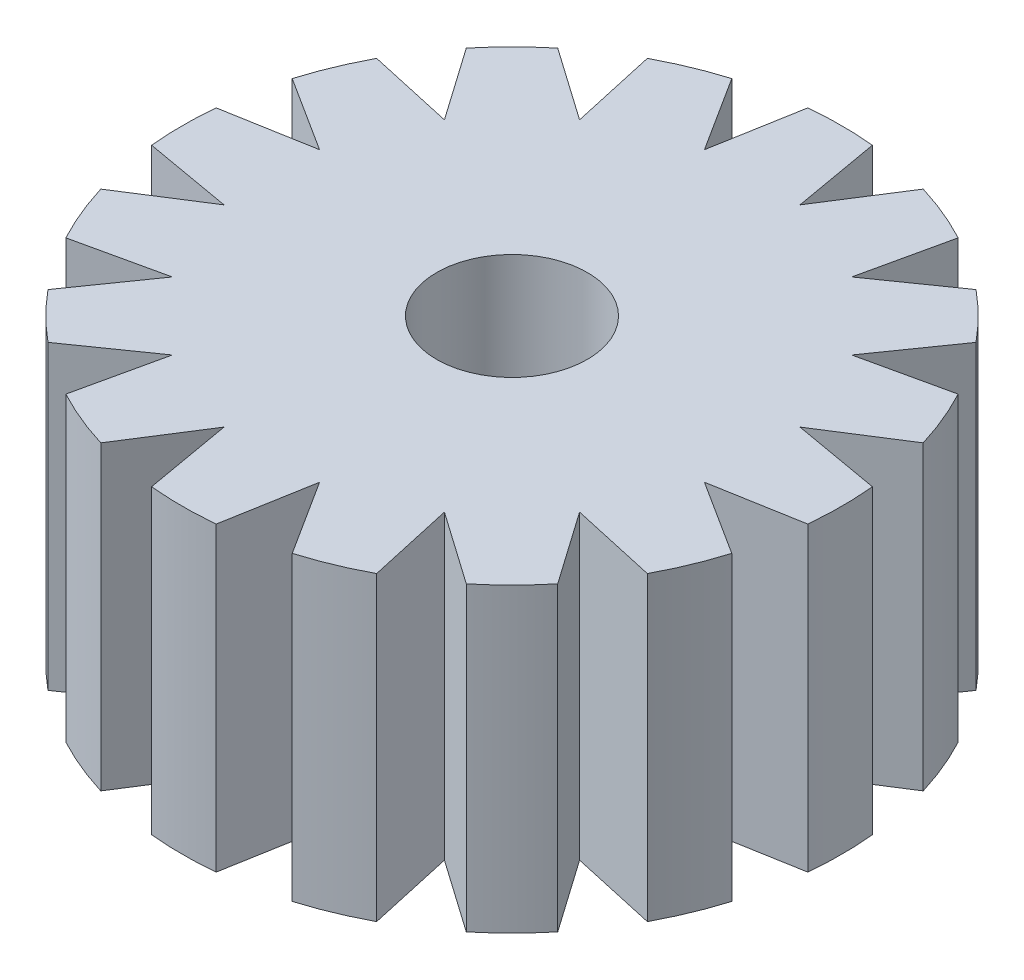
ISO-10303-21;
HEADER;
FILE_DESCRIPTION(('STEP AP214'),'2;1');
FILE_NAME('part.step','',(''),(''),'','','');
FILE_SCHEMA(('AUTOMOTIVE_DESIGN { 1 0 10303 214 1 1 1 1 }'));
ENDSEC;
DATA;
#1=APPLICATION_CONTEXT('core data for automotive mechanical design processes');
#2=APPLICATION_PROTOCOL_DEFINITION('international standard','automotive_design',2000,#1);
#3=PRODUCT_CONTEXT('',#1,'mechanical');
#4=PRODUCT('Part','Part','',(#3));
#5=PRODUCT_RELATED_PRODUCT_CATEGORY('part','',(#4));
#6=PRODUCT_DEFINITION_FORMATION('','',#4);
#7=PRODUCT_DEFINITION_CONTEXT('part definition',#1,'design');
#8=PRODUCT_DEFINITION('design','',#6,#7);
#9=PRODUCT_DEFINITION_SHAPE('','',#8);
#10=(LENGTH_UNIT() NAMED_UNIT(*) SI_UNIT(.MILLI.,.METRE.));
#11=(NAMED_UNIT(*) PLANE_ANGLE_UNIT() SI_UNIT($,.RADIAN.));
#12=(NAMED_UNIT(*) SI_UNIT($,.STERADIAN.) SOLID_ANGLE_UNIT());
#13=UNCERTAINTY_MEASURE_WITH_UNIT(LENGTH_MEASURE(1.E-05),#10,'distance_accuracy_value','');
#14=(GEOMETRIC_REPRESENTATION_CONTEXT(3) GLOBAL_UNCERTAINTY_ASSIGNED_CONTEXT((#13)) GLOBAL_UNIT_ASSIGNED_CONTEXT((#10,
#11,#12)) REPRESENTATION_CONTEXT('',''));
#15=CARTESIAN_POINT('',(0.,0.,0.));
#16=DIRECTION('',(0.,0.,1.));
#17=DIRECTION('',(1.,0.,0.));
#18=AXIS2_PLACEMENT_3D('',#15,#16,#17);
#19=CARTESIAN_POINT('',(-0.00277501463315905,8.,-0.00114944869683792));
#20=DIRECTION('',(0.,-1.,0.));
#21=DIRECTION('',(0.,0.,-1.));
#22=AXIS2_PLACEMENT_3D('',#19,#20,#21);
#23=CYLINDRICAL_SURFACE('',#22,6.49941468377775);
#24=DIRECTION('',(0.,-1.,0.));
#25=VECTOR('',#24,1.);
#26=CARTESIAN_POINT('',(-6.37759847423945,8.,-1.26764826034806));
#27=LINE('',#26,#25);
#28=CARTESIAN_POINT('',(-6.37759829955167,0.,-1.26764829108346));
#29=VERTEX_POINT('',#28);
#30=CARTESIAN_POINT('',(-6.37759829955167,8.,-1.26764829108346));
#31=VERTEX_POINT('',#30);
#32=EDGE_CURVE('E644',#29,#31,#27,.F.);
#33=ORIENTED_EDGE('',*,*,#32,.T.);
#34=CARTESIAN_POINT('',(-0.00277501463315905,8.,-0.00114944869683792));
#35=DIRECTION('',(0.,1.,0.));
#36=DIRECTION('',(0.,0.,1.));
#37=AXIS2_PLACEMENT_3D('',#34,#35,#36);
#38=CIRCLE('',#37,6.49941468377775);
#39=CARTESIAN_POINT('',(-6.37724069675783,8.,-1.26944692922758));
#40=VERTEX_POINT('',#39);
#41=EDGE_CURVE('E58',#40,#31,#38,.T.);
#42=ORIENTED_EDGE('',*,*,#41,.F.);
#43=DIRECTION('',(0.,-1.,0.));
#44=VECTOR('',#43,1.);
#45=CARTESIAN_POINT('',(-6.3772405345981,8.,-1.26944689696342));
#46=LINE('',#45,#44);
#47=CARTESIAN_POINT('',(-6.37724069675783,0.,-1.26944692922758));
#48=VERTEX_POINT('',#47);
#49=EDGE_CURVE('E609',#40,#48,#46,.T.);
#50=ORIENTED_EDGE('',*,*,#49,.T.);
#51=CARTESIAN_POINT('',(-0.00277501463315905,0.,-0.00114944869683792));
#52=DIRECTION('',(0.,1.,0.));
#53=DIRECTION('',(0.,0.,1.));
#54=AXIS2_PLACEMENT_3D('',#51,#52,#53);
#55=CIRCLE('',#54,6.49941468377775);
#56=EDGE_CURVE('E1041',#48,#29,#55,.T.);
#57=ORIENTED_EDGE('',*,*,#56,.T.);
#58=EDGE_LOOP('',(#33,#42,#50,#57));
#59=FACE_BOUND('',#58,.T.);
#60=ADVANCED_FACE('F35',(#59),#23,.T.);
#61=CARTESIAN_POINT('',(-5.40600570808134,0.,-3.61328030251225));
#62=VERTEX_POINT('',#61);
#63=CARTESIAN_POINT('',(-5.40702453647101,0.,-3.61175551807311));
#64=VERTEX_POINT('',#63);
#65=EDGE_CURVE('E1052',#62,#64,#55,.T.);
#66=ORIENTED_EDGE('',*,*,#65,.T.);
#67=DIRECTION('',(0.,-1.,0.));
#68=VECTOR('',#67,1.);
#69=CARTESIAN_POINT('',(-5.40702453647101,8.,-3.61175551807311));
#70=LINE('',#69,#68);
#71=CARTESIAN_POINT('',(-5.40702470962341,8.,-3.61175555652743));
#72=VERTEX_POINT('',#71);
#73=EDGE_CURVE('E1005',#72,#64,#70,.T.);
#74=ORIENTED_EDGE('',*,*,#73,.F.);
#75=CARTESIAN_POINT('',(-5.40600570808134,8.,-3.61328030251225));
#76=VERTEX_POINT('',#75);
#77=EDGE_CURVE('E1043',#76,#72,#38,.T.);
#78=ORIENTED_EDGE('',*,*,#77,.F.);
#79=DIRECTION('',(0.,-1.,0.));
#80=VECTOR('',#79,1.);
#81=CARTESIAN_POINT('',(-5.40600580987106,8.,-3.61328044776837));
#82=LINE('',#81,#80);
#83=EDGE_CURVE('E1002',#62,#76,#82,.F.);
#84=ORIENTED_EDGE('',*,*,#83,.F.);
#85=EDGE_LOOP('',(#66,#74,#78,#84));
#86=FACE_BOUND('',#85,.T.);
#87=ADVANCED_FACE('F1118',(#86),#23,.T.);
#88=CARTESIAN_POINT('',(3.61120651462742,8.,-5.40455247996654));
#89=DIRECTION('',(-0.976215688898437,0.,-0.216801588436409));
#90=DIRECTION('',(-0.216801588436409,0.,0.976215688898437));
#91=AXIS2_PLACEMENT_3D('',#88,#89,#90);
#92=PLANE('',#91);
#93=DIRECTION('',(0.,-1.,0.));
#94=VECTOR('',#93,1.);
#95=CARTESIAN_POINT('',(3.61175555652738,8.,-5.40702470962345));
#96=LINE('',#95,#94);
#97=CARTESIAN_POINT('',(3.61175555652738,0.,-5.40702470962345));
#98=VERTEX_POINT('',#97);
#99=CARTESIAN_POINT('',(3.61175555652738,8.,-5.40702470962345));
#100=VERTEX_POINT('',#99);
#101=EDGE_CURVE('E1038',#98,#100,#96,.F.);
#102=ORIENTED_EDGE('',*,*,#101,.F.);
#103=DIRECTION('',(0.216801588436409,0.,-0.976215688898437));
#104=VECTOR('',#103,1.);
#105=CARTESIAN_POINT('',(3.61120651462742,0.,-5.40455247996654));
#106=LINE('',#105,#104);
#107=CARTESIAN_POINT('',(4.12472144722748,0.,-7.71681106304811));
#108=VERTEX_POINT('',#107);
#109=EDGE_CURVE('E1053',#98,#108,#106,.T.);
#110=ORIENTED_EDGE('',*,*,#109,.T.);
#111=DIRECTION('',(0.,-1.,0.));
#112=VECTOR('',#111,1.);
#113=CARTESIAN_POINT('',(4.12472144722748,8.,-7.71681106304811));
#114=LINE('',#113,#112);
#115=CARTESIAN_POINT('',(4.12472144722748,8.,-7.71681106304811));
#116=VERTEX_POINT('',#115);
#117=EDGE_CURVE('E11',#116,#108,#114,.T.);
#118=ORIENTED_EDGE('',*,*,#117,.F.);
#119=DIRECTION('',(0.216801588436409,0.,-0.976215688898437));
#120=VECTOR('',#119,1.);
#121=CARTESIAN_POINT('',(3.61120651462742,8.,-5.40455247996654));
#122=LINE('',#121,#120);
#123=EDGE_CURVE('E1045',#100,#116,#122,.T.);
#124=ORIENTED_EDGE('',*,*,#123,.F.);
#125=EDGE_LOOP('',(#102,#110,#118,#124));
#126=FACE_BOUND('',#125,.T.);
#127=ADVANCED_FACE('F1177',(#126),#92,.F.);
#128=CARTESIAN_POINT('',(2.53999092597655,8.,-8.37322793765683));
#129=DIRECTION('',(0.843590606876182,0.,0.536986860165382));
#130=DIRECTION('',(0.536986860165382,0.,-0.843590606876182));
#131=AXIS2_PLACEMENT_3D('',#128,#129,#130);
#132=PLANE('',#131);
#133=DIRECTION('',(0.,-1.,0.));
#134=VECTOR('',#133,1.);
#135=CARTESIAN_POINT('',(1.26944699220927,8.,-6.37724068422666));
#136=LINE('',#135,#134);
#137=CARTESIAN_POINT('',(1.26944699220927,8.,-6.37724068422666));
#138=VERTEX_POINT('',#137);
#139=CARTESIAN_POINT('',(1.26944699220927,0.,-6.37724068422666));
#140=VERTEX_POINT('',#139);
#141=EDGE_CURVE('E50',#138,#140,#136,.T.);
#142=ORIENTED_EDGE('',*,*,#141,.F.);
#143=DIRECTION('',(-0.536986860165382,0.,0.843590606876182));
#144=VECTOR('',#143,1.);
#145=CARTESIAN_POINT('',(2.53999092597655,8.,-8.37322793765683));
#146=LINE('',#145,#144);
#147=CARTESIAN_POINT('',(2.53999092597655,8.,-8.37322793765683));
#148=VERTEX_POINT('',#147);
#149=EDGE_CURVE('E1049',#148,#138,#146,.T.);
#150=ORIENTED_EDGE('',*,*,#149,.F.);
#151=DIRECTION('',(0.,-1.,0.));
#152=VECTOR('',#151,1.);
#153=CARTESIAN_POINT('',(2.53999092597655,8.,-8.37322793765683));
#154=LINE('',#153,#152);
#155=CARTESIAN_POINT('',(2.53999092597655,0.,-8.37322793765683));
#156=VERTEX_POINT('',#155);
#157=EDGE_CURVE('E43',#148,#156,#154,.T.);
#158=ORIENTED_EDGE('',*,*,#157,.T.);
#159=DIRECTION('',(-0.536986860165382,0.,0.843590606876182));
#160=VECTOR('',#159,1.);
#161=CARTESIAN_POINT('',(2.53999092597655,0.,-8.37322793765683));
#162=LINE('',#161,#160);
#163=EDGE_CURVE('E1044',#156,#140,#162,.T.);
#164=ORIENTED_EDGE('',*,*,#163,.T.);
#165=EDGE_LOOP('',(#142,#150,#158,#164));
#166=FACE_BOUND('',#165,.T.);
#167=ADVANCED_FACE('F1061',(#166),#132,.F.);
#168=CARTESIAN_POINT('',(-3.02709246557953E-12,8.,7.28757332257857E-12));
#169=DIRECTION('',(0.,-1.,0.));
#170=DIRECTION('',(0.,0.,-1.));
#171=AXIS2_PLACEMENT_3D('',#168,#169,#170);
#172=CYLINDRICAL_SURFACE('',#171,8.75000000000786);
#173=CARTESIAN_POINT('',(-3.02709246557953E-12,0.,7.28757332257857E-12));
#174=DIRECTION('',(0.,1.,0.));
#175=DIRECTION('',(0.,0.,-1.));
#176=AXIS2_PLACEMENT_3D('',#173,#174,#175);
#177=CIRCLE('',#176,8.75000000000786);
#178=EDGE_CURVE('E1055',#108,#156,#177,.T.);
#179=ORIENTED_EDGE('',*,*,#178,.T.);
#180=ORIENTED_EDGE('',*,*,#157,.F.);
#181=CARTESIAN_POINT('',(-3.02709246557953E-12,8.,7.28757332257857E-12));
#182=DIRECTION('',(0.,1.,0.));
#183=DIRECTION('',(0.,0.,-1.));
#184=AXIS2_PLACEMENT_3D('',#181,#182,#183);
#185=CIRCLE('',#184,8.75000000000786);
#186=EDGE_CURVE('E1047',#116,#148,#185,.T.);
#187=ORIENTED_EDGE('',*,*,#186,.F.);
#188=ORIENTED_EDGE('',*,*,#117,.T.);
#189=EDGE_LOOP('',(#179,#180,#187,#188));
#190=FACE_BOUND('',#189,.T.);
#191=ADVANCED_FACE('F1185',(#190),#172,.T.);
#192=CARTESIAN_POINT('',(-0.00277501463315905,8.,-0.00114944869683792));
#193=DIRECTION('',(0.,1.,0.));
#194=DIRECTION('',(0.,0.,1.));
#195=AXIS2_PLACEMENT_3D('',#192,#193,#194);
#196=PLANE('',#195);
#197=CARTESIAN_POINT('',(-7.29357012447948E-12,8.,3.01261490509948E-12));
#198=DIRECTION('',(0.,1.,0.));
#199=DIRECTION('',(0.,0.,1.));
#200=AXIS2_PLACEMENT_3D('',#197,#198,#199);
#201=CIRCLE('',#200,2.);
#202=CARTESIAN_POINT('',(-7.29357012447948E-12,8.,2.00000000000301));
#203=VERTEX_POINT('',#202);
#204=EDGE_CURVE('E1157',#203,#203,#201,.T.);
#205=ORIENTED_EDGE('',*,*,#204,.F.);
#206=EDGE_LOOP('',(#205));
#207=FACE_BOUND('',#206,.T.);
#208=DIRECTION('',(0.57388012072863,0.,0.818939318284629));
#209=VECTOR('',#208,1.);
#210=CARTESIAN_POINT('',(-6.76384146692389,8.,-5.55094123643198));
#211=LINE('',#210,#209);
#212=CARTESIAN_POINT('',(-6.76384146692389,8.,-5.55094123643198));
#213=VERTEX_POINT('',#212);
#214=EDGE_CURVE('E591',#213,#76,#211,.T.);
#215=ORIENTED_EDGE('',*,*,#214,.T.);
#216=ORIENTED_EDGE('',*,*,#77,.T.);
#217=DIRECTION('',(-0.976215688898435,0.,-0.216801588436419));
#218=VECTOR('',#217,1.);
#219=CARTESIAN_POINT('',(-5.4045524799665,8.,-3.61120651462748));
#220=LINE('',#219,#218);
#221=CARTESIAN_POINT('',(-7.71681106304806,8.,-4.12472144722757));
#222=VERTEX_POINT('',#221);
#223=EDGE_CURVE('E618',#72,#222,#220,.T.);
#224=ORIENTED_EDGE('',*,*,#223,.T.);
#225=CARTESIAN_POINT('',(7.28757332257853E-12,8.,3.0270924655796E-12));
#226=DIRECTION('',(0.,1.,0.));
#227=DIRECTION('',(-1.,0.,0.));
#228=AXIS2_PLACEMENT_3D('',#225,#226,#227);
#229=CIRCLE('',#228,8.75000000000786);
#230=CARTESIAN_POINT('',(-8.3732279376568,8.,-2.53999092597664));
#231=VERTEX_POINT('',#230);
#232=EDGE_CURVE('E621',#222,#231,#229,.T.);
#233=ORIENTED_EDGE('',*,*,#232,.T.);
#234=DIRECTION('',(0.843590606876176,0.,0.53698686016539));
#235=VECTOR('',#234,1.);
#236=CARTESIAN_POINT('',(-8.3732279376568,8.,-2.53999092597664));
#237=LINE('',#236,#235);
#238=EDGE_CURVE('E623',#231,#40,#237,.T.);
#239=ORIENTED_EDGE('',*,*,#238,.T.);
#240=ORIENTED_EDGE('',*,*,#41,.T.);
#241=DIRECTION('',(-0.984872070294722,0.,0.173283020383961));
#242=VECTOR('',#241,1.);
#243=CARTESIAN_POINT('',(-6.37510432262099,8.,-1.26808709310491));
#244=LINE('',#243,#242);
#245=CARTESIAN_POINT('',(-8.70786635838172,8.,-0.857649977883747));
#246=VERTEX_POINT('',#245);
#247=EDGE_CURVE('E653',#31,#246,#244,.T.);
#248=ORIENTED_EDGE('',*,*,#247,.T.);
#249=CARTESIAN_POINT('',(7.89125796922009E-12,8.,0.));
#250=DIRECTION('',(0.,1.,0.));
#251=DIRECTION('',(-0.923879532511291,0.,0.382683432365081));
#252=AXIS2_PLACEMENT_3D('',#249,#250,#251);
#253=CIRCLE('',#252,8.75000000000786);
#254=CARTESIAN_POINT('',(-8.70786635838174,8.,0.857649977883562));
#255=VERTEX_POINT('',#254);
#256=EDGE_CURVE('E656',#246,#255,#253,.T.);
#257=ORIENTED_EDGE('',*,*,#256,.T.);
#258=DIRECTION('',(0.984872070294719,0.,0.17328302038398));
#259=VECTOR('',#258,1.);
#260=CARTESIAN_POINT('',(-8.70786635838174,8.,0.857649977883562));
#261=LINE('',#260,#259);
#262=CARTESIAN_POINT('',(-6.37759847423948,8.,1.26764826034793));
#263=VERTEX_POINT('',#262);
#264=EDGE_CURVE('E658',#255,#263,#261,.T.);
#265=ORIENTED_EDGE('',*,*,#264,.T.);
#266=CARTESIAN_POINT('',(-0.00300365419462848,8.,0.));
#267=DIRECTION('',(0.,1.,0.));
#268=DIRECTION('',(0.382683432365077,0.,0.923879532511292));
#269=AXIS2_PLACEMENT_3D('',#266,#267,#268);
#270=CIRCLE('',#269,6.49941468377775);
#271=CARTESIAN_POINT('',(-6.37741956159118,8.,1.2685476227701));
#272=VERTEX_POINT('',#271);
#273=EDGE_CURVE('E520',#263,#272,#270,.T.);
#274=ORIENTED_EDGE('',*,*,#273,.T.);
#275=CARTESIAN_POINT('',(-0.00277501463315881,8.,0.0011494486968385));
#276=DIRECTION('',(0.,1.,0.));
#277=DIRECTION('',(0.707106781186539,0.,0.707106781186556));
#278=AXIS2_PLACEMENT_3D('',#275,#276,#277);
#279=CIRCLE('',#278,6.49941468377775);
#280=CARTESIAN_POINT('',(-6.37724068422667,8.,1.26944699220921));
#281=VERTEX_POINT('',#280);
#282=EDGE_CURVE('E552',#272,#281,#279,.T.);
#283=ORIENTED_EDGE('',*,*,#282,.T.);
#284=DIRECTION('',(-0.843590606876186,0.,0.536986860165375));
#285=VECTOR('',#284,1.);
#286=CARTESIAN_POINT('',(-6.37510432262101,8.,1.26808709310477));
#287=LINE('',#286,#285);
#288=CARTESIAN_POINT('',(-8.37322793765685,8.,2.53999092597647));
#289=VERTEX_POINT('',#288);
#290=EDGE_CURVE('E689',#281,#289,#287,.T.);
#291=ORIENTED_EDGE('',*,*,#290,.T.);
#292=CARTESIAN_POINT('',(7.2935701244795E-12,8.,-3.01261490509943E-12));
#293=DIRECTION('',(0.,1.,0.));
#294=DIRECTION('',(-0.707106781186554,0.,0.707106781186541));
#295=AXIS2_PLACEMENT_3D('',#292,#293,#294);
#296=CIRCLE('',#295,8.75000000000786);
#297=CARTESIAN_POINT('',(-7.71681106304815,8.,4.12472144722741));
#298=VERTEX_POINT('',#297);
#299=EDGE_CURVE('E692',#289,#298,#296,.T.);
#300=ORIENTED_EDGE('',*,*,#299,.T.);
#301=DIRECTION('',(0.976215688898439,0.,-0.216801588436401));
#302=VECTOR('',#301,1.);
#303=CARTESIAN_POINT('',(-7.71681106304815,8.,4.12472144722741));
#304=LINE('',#303,#302);
#305=CARTESIAN_POINT('',(-5.40702470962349,8.,3.61175555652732));
#306=VERTEX_POINT('',#305);
#307=EDGE_CURVE('E694',#298,#306,#304,.T.);
#308=ORIENTED_EDGE('',*,*,#307,.T.);
#309=CARTESIAN_POINT('',(-5.40651524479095,8.,3.61251799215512));
#310=VERTEX_POINT('',#309);
#311=EDGE_CURVE('E556',#306,#310,#279,.T.);
#312=ORIENTED_EDGE('',*,*,#311,.T.);
#313=CARTESIAN_POINT('',(-0.002123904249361,8.,0.00212390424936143));
#314=DIRECTION('',(0.,1.,0.));
#315=DIRECTION('',(0.923879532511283,0.,0.3826834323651));
#316=AXIS2_PLACEMENT_3D('',#313,#314,#315);
#317=CIRCLE('',#316,6.49941468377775);
#318=CARTESIAN_POINT('',(-5.40600580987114,8.,3.61328044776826));
#319=VERTEX_POINT('',#318);
#320=EDGE_CURVE('E583',#310,#319,#317,.T.);
#321=ORIENTED_EDGE('',*,*,#320,.T.);
#322=DIRECTION('',(-0.573880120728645,0.,0.818939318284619));
#323=VECTOR('',#322,1.);
#324=CARTESIAN_POINT('',(-5.40455247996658,8.,3.61120651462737));
#325=LINE('',#324,#323);
#326=CARTESIAN_POINT('',(-6.763841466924,8.,5.55094123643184));
#327=VERTEX_POINT('',#326);
#328=EDGE_CURVE('E725',#319,#327,#325,.T.);
#329=ORIENTED_EDGE('',*,*,#328,.T.);
#330=CARTESIAN_POINT('',(5.58550234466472E-12,8.,-5.57442169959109E-12));
#331=DIRECTION('',(0.,1.,0.));
#332=DIRECTION('',(-0.382683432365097,0.,0.923879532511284));
#333=AXIS2_PLACEMENT_3D('',#330,#331,#332);
#334=CIRCLE('',#333,8.75000000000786);
#335=CARTESIAN_POINT('',(-5.55094123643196,8.,6.7638414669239));
#336=VERTEX_POINT('',#335);
#337=EDGE_CURVE('E728',#327,#336,#334,.T.);
#338=ORIENTED_EDGE('',*,*,#337,.T.);
#339=DIRECTION('',(0.818939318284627,0.,-0.573880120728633));
#340=VECTOR('',#339,1.);
#341=CARTESIAN_POINT('',(-5.55094123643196,8.,6.7638414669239));
#342=LINE('',#341,#340);
#343=CARTESIAN_POINT('',(-3.61328044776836,8.,5.40600580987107));
#344=VERTEX_POINT('',#343);
#345=EDGE_CURVE('E730',#336,#344,#342,.T.);
#346=ORIENTED_EDGE('',*,*,#345,.T.);
#347=CARTESIAN_POINT('',(-3.61251799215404,8.,5.40651524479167));
#348=VERTEX_POINT('',#347);
#349=EDGE_CURVE('E587',#344,#348,#317,.T.);
#350=ORIENTED_EDGE('',*,*,#349,.T.);
#351=CARTESIAN_POINT('',(-0.00114944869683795,8.,0.00277501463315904));
#352=DIRECTION('',(0.,1.,0.));
#353=DIRECTION('',(1.,0.,0.));
#354=AXIS2_PLACEMENT_3D('',#351,#352,#353);
#355=CIRCLE('',#354,6.49941468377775);
#356=CARTESIAN_POINT('',(-3.61175555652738,8.,5.40702470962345));
#357=VERTEX_POINT('',#356);
#358=EDGE_CURVE('E615',#348,#357,#355,.T.);
#359=ORIENTED_EDGE('',*,*,#358,.T.);
#360=DIRECTION('',(-0.216801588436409,0.,0.976215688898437));
#361=VECTOR('',#360,1.);
#362=CARTESIAN_POINT('',(-3.61120651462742,8.,5.40455247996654));
#363=LINE('',#362,#361);
#364=CARTESIAN_POINT('',(-4.12472144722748,8.,7.71681106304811));
#365=VERTEX_POINT('',#364);
#366=EDGE_CURVE('E761',#357,#365,#363,.T.);
#367=ORIENTED_EDGE('',*,*,#366,.T.);
#368=CARTESIAN_POINT('',(3.02709246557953E-12,8.,-7.28757332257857E-12));
#369=DIRECTION('',(0.,1.,0.));
#370=DIRECTION('',(0.,0.,1.));
#371=AXIS2_PLACEMENT_3D('',#368,#369,#370);
#372=CIRCLE('',#371,8.75000000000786);
#373=CARTESIAN_POINT('',(-2.53999092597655,8.,8.37322793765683));
#374=VERTEX_POINT('',#373);
#375=EDGE_CURVE('E764',#365,#374,#372,.T.);
#376=ORIENTED_EDGE('',*,*,#375,.T.);
#377=DIRECTION('',(0.536986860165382,0.,-0.843590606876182));
#378=VECTOR('',#377,1.);
#379=CARTESIAN_POINT('',(-2.53999092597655,8.,8.37322793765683));
#380=LINE('',#379,#378);
#381=CARTESIAN_POINT('',(-1.26944699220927,8.,6.37724068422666));
#382=VERTEX_POINT('',#381);
#383=EDGE_CURVE('E766',#374,#382,#380,.T.);
#384=ORIENTED_EDGE('',*,*,#383,.T.);
#385=CARTESIAN_POINT('',(-1.26854762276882,8.,6.37741956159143));
#386=VERTEX_POINT('',#385);
#387=EDGE_CURVE('E619',#382,#386,#355,.T.);
#388=ORIENTED_EDGE('',*,*,#387,.T.);
#389=CARTESIAN_POINT('',(0.,8.,0.00300365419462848));
#390=DIRECTION('',(0.,1.,0.));
#391=DIRECTION('',(0.923879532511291,0.,-0.382683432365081));
#392=AXIS2_PLACEMENT_3D('',#389,#390,#391);
#393=CIRCLE('',#392,6.49941468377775);
#394=CARTESIAN_POINT('',(-1.26764826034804,8.,6.37759847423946));
#395=VERTEX_POINT('',#394);
#396=EDGE_CURVE('E650',#386,#395,#393,.T.);
#397=ORIENTED_EDGE('',*,*,#396,.T.);
#398=DIRECTION('',(0.173283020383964,0.,0.984872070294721));
#399=VECTOR('',#398,1.);
#400=CARTESIAN_POINT('',(-1.26808709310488,8.,6.37510432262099));
#401=LINE('',#400,#399);
#402=CARTESIAN_POINT('',(-0.857649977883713,8.,8.70786635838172));
#403=VERTEX_POINT('',#402);
#404=EDGE_CURVE('E797',#395,#403,#401,.T.);
#405=ORIENTED_EDGE('',*,*,#404,.T.);
#406=CARTESIAN_POINT('',(0.,8.,-7.89125796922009E-12));
#407=DIRECTION('',(0.,1.,0.));
#408=DIRECTION('',(0.382683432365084,0.,0.923879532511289));
#409=AXIS2_PLACEMENT_3D('',#406,#407,#408);
#410=CIRCLE('',#409,8.75000000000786);
#411=CARTESIAN_POINT('',(0.857649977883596,8.,8.70786635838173));
#412=VERTEX_POINT('',#411);
#413=EDGE_CURVE('E800',#403,#412,#410,.T.);
#414=ORIENTED_EDGE('',*,*,#413,.T.);
#415=DIRECTION('',(0.173283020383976,0.,-0.984872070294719));
#416=VECTOR('',#415,1.);
#417=CARTESIAN_POINT('',(0.857649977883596,8.,8.70786635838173));
#418=LINE('',#417,#416);
#419=CARTESIAN_POINT('',(1.26764826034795,8.,6.37759847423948));
#420=VERTEX_POINT('',#419);
#421=EDGE_CURVE('E802',#412,#420,#418,.T.);
#422=ORIENTED_EDGE('',*,*,#421,.T.);
#423=CARTESIAN_POINT('',(1.26854762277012,8.,6.37741956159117));
#424=VERTEX_POINT('',#423);
#425=EDGE_CURVE('E654',#420,#424,#393,.T.);
#426=ORIENTED_EDGE('',*,*,#425,.T.);
#427=CARTESIAN_POINT('',(0.00114944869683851,8.,0.00277501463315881));
#428=DIRECTION('',(0.,1.,0.));
#429=DIRECTION('',(0.707106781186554,0.,-0.707106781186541));
#430=AXIS2_PLACEMENT_3D('',#427,#428,#429);
#431=CIRCLE('',#430,6.49941468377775);
#432=CARTESIAN_POINT('',(1.26944699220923,8.,6.37724068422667));
#433=VERTEX_POINT('',#432);
#434=EDGE_CURVE('E686',#424,#433,#431,.T.);
#435=ORIENTED_EDGE('',*,*,#434,.T.);
#436=DIRECTION('',(0.536986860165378,0.,0.843590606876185));
#437=VECTOR('',#436,1.);
#438=CARTESIAN_POINT('',(1.26808709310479,8.,6.37510432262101));
#439=LINE('',#438,#437);
#440=CARTESIAN_POINT('',(2.5399909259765,8.,8.37322793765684));
#441=VERTEX_POINT('',#440);
#442=EDGE_CURVE('E833',#433,#441,#439,.T.);
#443=ORIENTED_EDGE('',*,*,#442,.T.);
#444=CARTESIAN_POINT('',(-3.01261490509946E-12,8.,-7.29357012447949E-12));
#445=DIRECTION('',(0.,1.,0.));
#446=DIRECTION('',(0.707106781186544,0.,0.707106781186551));
#447=AXIS2_PLACEMENT_3D('',#444,#445,#446);
#448=CIRCLE('',#447,8.75000000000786);
#449=CARTESIAN_POINT('',(4.12472144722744,8.,7.71681106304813));
#450=VERTEX_POINT('',#449);
#451=EDGE_CURVE('E836',#441,#450,#448,.T.);
#452=ORIENTED_EDGE('',*,*,#451,.T.);
#453=DIRECTION('',(-0.216801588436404,0.,-0.976215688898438));
#454=VECTOR('',#453,1.);
#455=CARTESIAN_POINT('',(4.12472144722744,8.,7.71681106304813));
#456=LINE('',#455,#454);
#457=CARTESIAN_POINT('',(3.61175555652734,8.,5.40702470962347));
#458=VERTEX_POINT('',#457);
#459=EDGE_CURVE('E838',#450,#458,#456,.T.);
#460=ORIENTED_EDGE('',*,*,#459,.T.);
#461=CARTESIAN_POINT('',(3.61251799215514,8.,5.40651524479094));
#462=VERTEX_POINT('',#461);
#463=EDGE_CURVE('E690',#458,#462,#431,.T.);
#464=ORIENTED_EDGE('',*,*,#463,.T.);
#465=CARTESIAN_POINT('',(0.00212390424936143,8.,0.00212390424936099));
#466=DIRECTION('',(0.,1.,0.));
#467=DIRECTION('',(0.382683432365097,0.,-0.923879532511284));
#468=AXIS2_PLACEMENT_3D('',#465,#466,#467);
#469=CIRCLE('',#468,6.49941468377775);
#470=CARTESIAN_POINT('',(3.61328044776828,8.,5.40600580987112));
#471=VERTEX_POINT('',#470);
#472=EDGE_CURVE('E722',#462,#471,#469,.T.);
#473=ORIENTED_EDGE('',*,*,#472,.T.);
#474=DIRECTION('',(0.818939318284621,0.,0.573880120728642));
#475=VECTOR('',#474,1.);
#476=CARTESIAN_POINT('',(3.61120651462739,8.,5.40455247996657));
#477=LINE('',#476,#475);
#478=CARTESIAN_POINT('',(5.55094123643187,8.,6.76384146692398));
#479=VERTEX_POINT('',#478);
#480=EDGE_CURVE('E869',#471,#479,#477,.T.);
#481=ORIENTED_EDGE('',*,*,#480,.T.);
#482=CARTESIAN_POINT('',(-5.57442169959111E-12,8.,-5.58550234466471E-12));
#483=DIRECTION('',(0.,1.,0.));
#484=DIRECTION('',(0.923879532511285,0.,0.382683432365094));
#485=AXIS2_PLACEMENT_3D('',#482,#483,#484);
#486=CIRCLE('',#485,8.75000000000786);
#487=CARTESIAN_POINT('',(6.76384146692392,8.,5.55094123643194));
#488=VERTEX_POINT('',#487);
#489=EDGE_CURVE('E872',#479,#488,#486,.T.);
#490=ORIENTED_EDGE('',*,*,#489,.T.);
#491=DIRECTION('',(-0.573880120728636,0.,-0.818939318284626));
#492=VECTOR('',#491,1.);
#493=CARTESIAN_POINT('',(6.76384146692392,8.,5.55094123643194));
#494=LINE('',#493,#492);
#495=CARTESIAN_POINT('',(5.40600580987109,8.,3.61328044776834));
#496=VERTEX_POINT('',#495);
#497=EDGE_CURVE('E874',#488,#496,#494,.T.);
#498=ORIENTED_EDGE('',*,*,#497,.T.);
#499=CARTESIAN_POINT('',(5.4065152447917,8.,3.61251799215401));
#500=VERTEX_POINT('',#499);
#501=EDGE_CURVE('E726',#496,#500,#469,.T.);
#502=ORIENTED_EDGE('',*,*,#501,.T.);
#503=CARTESIAN_POINT('',(0.00277501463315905,8.,0.00114944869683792));
#504=DIRECTION('',(0.,1.,0.));
#505=DIRECTION('',(0.,0.,-1.));
#506=AXIS2_PLACEMENT_3D('',#503,#504,#505);
#507=CIRCLE('',#506,6.49941468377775);
#508=CARTESIAN_POINT('',(5.40702470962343,8.,3.61175555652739));
#509=VERTEX_POINT('',#508);
#510=EDGE_CURVE('E758',#500,#509,#507,.T.);
#511=ORIENTED_EDGE('',*,*,#510,.T.);
#512=DIRECTION('',(0.976215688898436,0.,0.216801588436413));
#513=VECTOR('',#512,1.);
#514=CARTESIAN_POINT('',(5.40455247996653,8.,3.61120651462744));
#515=LINE('',#514,#513);
#516=CARTESIAN_POINT('',(7.71681106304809,8.,4.12472144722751));
#517=VERTEX_POINT('',#516);
#518=EDGE_CURVE('E907',#509,#517,#515,.T.);
#519=ORIENTED_EDGE('',*,*,#518,.T.);
#520=CARTESIAN_POINT('',(-7.28757332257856E-12,8.,-3.02709246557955E-12));
#521=DIRECTION('',(0.,1.,0.));
#522=DIRECTION('',(1.,0.,0.));
#523=AXIS2_PLACEMENT_3D('',#520,#521,#522);
#524=CIRCLE('',#523,8.75000000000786);
#525=CARTESIAN_POINT('',(8.37322793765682,8.,2.53999092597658));
#526=VERTEX_POINT('',#525);
#527=EDGE_CURVE('E910',#517,#526,#524,.T.);
#528=ORIENTED_EDGE('',*,*,#527,.T.);
#529=DIRECTION('',(-0.84359060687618,0.,-0.536986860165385));
#530=VECTOR('',#529,1.);
#531=CARTESIAN_POINT('',(8.37322793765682,8.,2.53999092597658));
#532=LINE('',#531,#530);
#533=CARTESIAN_POINT('',(6.37724068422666,8.,1.2694469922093));
#534=VERTEX_POINT('',#533);
#535=EDGE_CURVE('E912',#526,#534,#532,.T.);
#536=ORIENTED_EDGE('',*,*,#535,.T.);
#537=CARTESIAN_POINT('',(6.37741956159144,8.,1.26854762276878));
#538=VERTEX_POINT('',#537);
#539=EDGE_CURVE('E762',#534,#538,#507,.T.);
#540=ORIENTED_EDGE('',*,*,#539,.T.);
#541=CARTESIAN_POINT('',(0.00300365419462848,8.,0.));
#542=DIRECTION('',(0.,1.,0.));
#543=DIRECTION('',(-0.382683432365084,0.,-0.923879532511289));
#544=AXIS2_PLACEMENT_3D('',#541,#542,#543);
#545=CIRCLE('',#544,6.49941468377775);
#546=CARTESIAN_POINT('',(6.37759847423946,8.,1.26764826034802));
#547=VERTEX_POINT('',#546);
#548=EDGE_CURVE('E794',#538,#547,#545,.T.);
#549=ORIENTED_EDGE('',*,*,#548,.T.);
#550=DIRECTION('',(0.984872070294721,0.,-0.173283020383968));
#551=VECTOR('',#550,1.);
#552=CARTESIAN_POINT('',(6.37510432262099,8.,1.26808709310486));
#553=LINE('',#552,#551);
#554=CARTESIAN_POINT('',(8.70786635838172,8.,0.857649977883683));
#555=VERTEX_POINT('',#554);
#556=EDGE_CURVE('E947',#547,#555,#553,.T.);
#557=ORIENTED_EDGE('',*,*,#556,.T.);
#558=CARTESIAN_POINT('',(-7.89125796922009E-12,8.,0.));
#559=DIRECTION('',(0.,1.,0.));
#560=DIRECTION('',(0.923879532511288,0.,-0.382683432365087));
#561=AXIS2_PLACEMENT_3D('',#558,#559,#560);
#562=CIRCLE('',#561,8.75000000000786);
#563=CARTESIAN_POINT('',(8.70786635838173,8.,-0.857649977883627));
#564=VERTEX_POINT('',#563);
#565=EDGE_CURVE('E950',#555,#564,#562,.T.);
#566=ORIENTED_EDGE('',*,*,#565,.T.);
#567=DIRECTION('',(-0.98487207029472,0.,-0.173283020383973));
#568=VECTOR('',#567,1.);
#569=CARTESIAN_POINT('',(8.70786635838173,8.,-0.857649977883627));
#570=LINE('',#569,#568);
#571=CARTESIAN_POINT('',(6.37759847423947,8.,-1.26764826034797));
#572=VERTEX_POINT('',#571);
#573=EDGE_CURVE('E952',#564,#572,#570,.T.);
#574=ORIENTED_EDGE('',*,*,#573,.T.);
#575=CARTESIAN_POINT('',(6.37741956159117,8.,-1.26854762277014));
#576=VERTEX_POINT('',#575);
#577=EDGE_CURVE('E798',#572,#576,#545,.T.);
#578=ORIENTED_EDGE('',*,*,#577,.T.);
#579=CARTESIAN_POINT('',(0.0027750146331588,8.,-0.00114944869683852));
#580=DIRECTION('',(0.,1.,0.));
#581=DIRECTION('',(-0.707106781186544,0.,-0.707106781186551));
#582=AXIS2_PLACEMENT_3D('',#579,#580,#581);
#583=CIRCLE('',#582,6.49941468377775);
#584=CARTESIAN_POINT('',(6.37724068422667,8.,-1.26944699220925));
#585=VERTEX_POINT('',#584);
#586=EDGE_CURVE('E830',#576,#585,#583,.T.);
#587=ORIENTED_EDGE('',*,*,#586,.T.);
#588=DIRECTION('',(0.843590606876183,0.,-0.53698686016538));
#589=VECTOR('',#588,1.);
#590=CARTESIAN_POINT('',(6.375104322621,8.,-1.26808709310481));
#591=LINE('',#590,#589);
#592=CARTESIAN_POINT('',(8.37322793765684,8.,-2.53999092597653));
#593=VERTEX_POINT('',#592);
#594=EDGE_CURVE('E982',#585,#593,#591,.T.);
#595=ORIENTED_EDGE('',*,*,#594,.T.);
#596=CARTESIAN_POINT('',(-7.29357012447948E-12,8.,3.01261490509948E-12));
#597=DIRECTION('',(0.,1.,0.));
#598=DIRECTION('',(0.707106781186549,0.,-0.707106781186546));
#599=AXIS2_PLACEMENT_3D('',#596,#597,#598);
#600=CIRCLE('',#599,8.75000000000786);
#601=CARTESIAN_POINT('',(7.71681106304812,8.,-4.12472144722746));
#602=VERTEX_POINT('',#601);
#603=EDGE_CURVE('E985',#593,#602,#600,.T.);
#604=ORIENTED_EDGE('',*,*,#603,.T.);
#605=DIRECTION('',(-0.976215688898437,0.,0.216801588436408));
#606=VECTOR('',#605,1.);
#607=CARTESIAN_POINT('',(7.71681106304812,8.,-4.12472144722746));
#608=LINE('',#607,#606);
#609=CARTESIAN_POINT('',(5.40702470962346,8.,-3.61175555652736));
#610=VERTEX_POINT('',#609);
#611=EDGE_CURVE('E987',#602,#610,#608,.T.);
#612=ORIENTED_EDGE('',*,*,#611,.T.);
#613=CARTESIAN_POINT('',(5.40651524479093,8.,-3.61251799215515));
#614=VERTEX_POINT('',#613);
#615=EDGE_CURVE('E834',#610,#614,#583,.T.);
#616=ORIENTED_EDGE('',*,*,#615,.T.);
#617=CARTESIAN_POINT('',(0.00212390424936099,8.,-0.00212390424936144));
#618=DIRECTION('',(0.,1.,0.));
#619=DIRECTION('',(-0.923879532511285,0.,-0.382683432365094));
#620=AXIS2_PLACEMENT_3D('',#617,#618,#619);
#621=CIRCLE('',#620,6.49941468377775);
#622=CARTESIAN_POINT('',(5.40600580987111,8.,-3.6132804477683));
#623=VERTEX_POINT('',#622);
#624=EDGE_CURVE('E866',#614,#623,#621,.T.);
#625=ORIENTED_EDGE('',*,*,#624,.T.);
#626=DIRECTION('',(0.573880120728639,0.,-0.818939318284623));
#627=VECTOR('',#626,1.);
#628=CARTESIAN_POINT('',(5.40455247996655,8.,-3.6112065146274));
#629=LINE('',#628,#627);
#630=CARTESIAN_POINT('',(6.76384146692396,8.,-5.55094123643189));
#631=VERTEX_POINT('',#630);
#632=EDGE_CURVE('E1017',#623,#631,#629,.T.);
#633=ORIENTED_EDGE('',*,*,#632,.T.);
#634=CARTESIAN_POINT('',(-5.58550234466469E-12,8.,5.57442169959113E-12));
#635=DIRECTION('',(0.,1.,0.));
#636=DIRECTION('',(0.382683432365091,0.,-0.923879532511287));
#637=AXIS2_PLACEMENT_3D('',#634,#635,#636);
#638=CIRCLE('',#637,8.75000000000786);
#639=CARTESIAN_POINT('',(5.55094123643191,8.,-6.76384146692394));
#640=VERTEX_POINT('',#639);
#641=EDGE_CURVE('E1020',#631,#640,#638,.T.);
#642=ORIENTED_EDGE('',*,*,#641,.T.);
#643=DIRECTION('',(-0.818939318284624,0.,0.573880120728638));
#644=VECTOR('',#643,1.);
#645=CARTESIAN_POINT('',(5.55094123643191,8.,-6.76384146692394));
#646=LINE('',#645,#644);
#647=CARTESIAN_POINT('',(3.61328044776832,8.,-5.4060058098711));
#648=VERTEX_POINT('',#647);
#649=EDGE_CURVE('E1022',#640,#648,#646,.T.);
#650=ORIENTED_EDGE('',*,*,#649,.T.);
#651=CARTESIAN_POINT('',(3.612517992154,8.,-5.4065152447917));
#652=VERTEX_POINT('',#651);
#653=EDGE_CURVE('E870',#648,#652,#621,.T.);
#654=ORIENTED_EDGE('',*,*,#653,.T.);
#655=CARTESIAN_POINT('',(0.00114944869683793,8.,-0.00277501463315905));
#656=DIRECTION('',(0.,1.,0.));
#657=DIRECTION('',(-1.,0.,0.));
#658=AXIS2_PLACEMENT_3D('',#655,#656,#657);
#659=CIRCLE('',#658,6.49941468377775);
#660=EDGE_CURVE('E904',#652,#100,#659,.T.);
#661=ORIENTED_EDGE('',*,*,#660,.T.);
#662=ORIENTED_EDGE('',*,*,#123,.T.);
#663=ORIENTED_EDGE('',*,*,#186,.T.);
#664=ORIENTED_EDGE('',*,*,#149,.T.);
#665=CARTESIAN_POINT('',(1.26854762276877,8.,-6.37741956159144));
#666=VERTEX_POINT('',#665);
#667=EDGE_CURVE('E908',#138,#666,#659,.T.);
#668=ORIENTED_EDGE('',*,*,#667,.T.);
#669=CARTESIAN_POINT('',(0.,8.,-0.00300365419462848));
#670=DIRECTION('',(0.,1.,0.));
#671=DIRECTION('',(-0.923879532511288,0.,0.382683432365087));
#672=AXIS2_PLACEMENT_3D('',#669,#670,#671);
#673=CIRCLE('',#672,6.49941468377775);
#674=CARTESIAN_POINT('',(1.26764826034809,8.,-6.37759847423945));
#675=VERTEX_POINT('',#674);
#676=EDGE_CURVE('E517',#666,#675,#673,.T.);
#677=ORIENTED_EDGE('',*,*,#676,.T.);
#678=DIRECTION('',(-0.173283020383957,0.,-0.984872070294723));
#679=VECTOR('',#678,1.);
#680=CARTESIAN_POINT('',(1.26808709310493,8.,-6.37510432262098));
#681=LINE('',#680,#679);
#682=CARTESIAN_POINT('',(0.857649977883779,8.,-8.70786635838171));
#683=VERTEX_POINT('',#682);
#684=EDGE_CURVE('E508',#675,#683,#681,.T.);
#685=ORIENTED_EDGE('',*,*,#684,.T.);
#686=CARTESIAN_POINT('',(0.,8.,7.89125796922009E-12));
#687=DIRECTION('',(0.,1.,0.));
#688=DIRECTION('',(-0.382683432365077,0.,-0.923879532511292));
#689=AXIS2_PLACEMENT_3D('',#686,#687,#688);
#690=CIRCLE('',#689,8.75000000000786);
#691=CARTESIAN_POINT('',(-0.857649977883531,8.,-8.70786635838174));
#692=VERTEX_POINT('',#691);
#693=EDGE_CURVE('E514',#683,#692,#690,.T.);
#694=ORIENTED_EDGE('',*,*,#693,.T.);
#695=DIRECTION('',(-0.173283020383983,0.,0.984872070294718));
#696=VECTOR('',#695,1.);
#697=CARTESIAN_POINT('',(-0.857649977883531,8.,-8.70786635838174));
#698=LINE('',#697,#696);
#699=CARTESIAN_POINT('',(-1.26764829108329,8.,-6.3775982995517));
#700=VERTEX_POINT('',#699);
#701=EDGE_CURVE('E535',#692,#700,#698,.T.);
#702=ORIENTED_EDGE('',*,*,#701,.T.);
#703=CARTESIAN_POINT('',(-0.00114944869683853,8.,-0.0027750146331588));
#704=DIRECTION('',(0.,1.,0.));
#705=DIRECTION('',(-0.707106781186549,0.,0.707106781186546));
#706=AXIS2_PLACEMENT_3D('',#703,#704,#705);
#707=CIRCLE('',#706,6.49941468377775);
#708=CARTESIAN_POINT('',(-1.26944699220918,8.,-6.37724068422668));
#709=VERTEX_POINT('',#708);
#710=EDGE_CURVE('E980',#700,#709,#707,.T.);
#711=ORIENTED_EDGE('',*,*,#710,.T.);
#712=DIRECTION('',(-0.536986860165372,0.,-0.843590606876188));
#713=VECTOR('',#712,1.);
#714=CARTESIAN_POINT('',(-1.26808709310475,8.,-6.37510432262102));
#715=LINE('',#714,#713);
#716=CARTESIAN_POINT('',(-2.53999092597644,8.,-8.37322793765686));
#717=VERTEX_POINT('',#716);
#718=EDGE_CURVE('E555',#709,#717,#715,.T.);
#719=ORIENTED_EDGE('',*,*,#718,.T.);
#720=CARTESIAN_POINT('',(3.0126149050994E-12,8.,7.29357012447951E-12));
#721=DIRECTION('',(0.,1.,0.));
#722=DIRECTION('',(-0.707106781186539,0.,-0.707106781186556));
#723=AXIS2_PLACEMENT_3D('',#720,#721,#722);
#724=CIRCLE('',#723,8.75000000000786);
#725=CARTESIAN_POINT('',(-4.12472144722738,8.,-7.71681106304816));
#726=VERTEX_POINT('',#725);
#727=EDGE_CURVE('E558',#717,#726,#724,.T.);
#728=ORIENTED_EDGE('',*,*,#727,.T.);
#729=DIRECTION('',(0.216801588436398,0.,0.97621568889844));
#730=VECTOR('',#729,1.);
#731=CARTESIAN_POINT('',(-4.12472144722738,8.,-7.71681106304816));
#732=LINE('',#731,#730);
#733=CARTESIAN_POINT('',(-3.61175551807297,8.,-5.4070245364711));
#734=VERTEX_POINT('',#733);
#735=EDGE_CURVE('E560',#726,#734,#732,.T.);
#736=ORIENTED_EDGE('',*,*,#735,.T.);
#737=CARTESIAN_POINT('',(-0.00212390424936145,8.,-0.00212390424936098));
#738=DIRECTION('',(0.,1.,0.));
#739=DIRECTION('',(-0.382683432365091,0.,0.923879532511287));
#740=AXIS2_PLACEMENT_3D('',#737,#738,#739);
#741=CIRCLE('',#740,6.49941468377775);
#742=CARTESIAN_POINT('',(-3.61328044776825,8.,-5.40600580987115));
#743=VERTEX_POINT('',#742);
#744=EDGE_CURVE('E1015',#734,#743,#741,.T.);
#745=ORIENTED_EDGE('',*,*,#744,.T.);
#746=DIRECTION('',(-0.818939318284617,0.,-0.573880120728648));
#747=VECTOR('',#746,1.);
#748=CARTESIAN_POINT('',(-3.61120651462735,8.,-5.40455247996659));
#749=LINE('',#748,#747);
#750=CARTESIAN_POINT('',(-5.55094123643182,8.,-6.76384146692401));
#751=VERTEX_POINT('',#750);
#752=EDGE_CURVE('E586',#743,#751,#749,.T.);
#753=ORIENTED_EDGE('',*,*,#752,.T.);
#754=CARTESIAN_POINT('',(5.57442169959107E-12,8.,5.58550234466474E-12));
#755=DIRECTION('',(0.,1.,0.));
#756=DIRECTION('',(-0.923879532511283,0.,-0.3826834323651));
#757=AXIS2_PLACEMENT_3D('',#754,#755,#756);
#758=CIRCLE('',#757,8.75000000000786);
#759=EDGE_CURVE('E589',#751,#213,#758,.T.);
#760=ORIENTED_EDGE('',*,*,#759,.T.);
#761=EDGE_LOOP('',(#215,#216,#224,#233,#239,#240,#248,#257,#265,#274,#283,#291,#300,#308,#312,
#321,#329,#338,#346,#350,#359,#367,#376,#384,#388,#397,#405,#414,#422,#426,#435,#443,#452,#460,
#464,#473,#481,#490,#498,#502,#511,#519,#528,#536,#540,#549,#557,#566,#574,#578,#587,#595,#604,
#612,#616,#625,#633,#642,#650,#654,#661,#662,#663,#664,#668,#677,#685,#694,#702,#711,#719,#728,
#736,#745,#753,#760));
#762=FACE_BOUND('',#761,.T.);
#763=ADVANCED_FACE('F511',(#207,#762),#196,.T.);
#764=CARTESIAN_POINT('',(-0.00277501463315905,0.,-0.00114944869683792));
#765=DIRECTION('',(0.,1.,0.));
#766=DIRECTION('',(0.,0.,1.));
#767=AXIS2_PLACEMENT_3D('',#764,#765,#766);
#768=PLANE('',#767);
#769=CARTESIAN_POINT('',(-7.29357012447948E-12,0.,3.01261490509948E-12));
#770=DIRECTION('',(0.,1.,0.));
#771=DIRECTION('',(0.,0.,1.));
#772=AXIS2_PLACEMENT_3D('',#769,#770,#771);
#773=CIRCLE('',#772,2.);
#774=CARTESIAN_POINT('',(-7.29357012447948E-12,0.,2.00000000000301));
#775=VERTEX_POINT('',#774);
#776=EDGE_CURVE('E38',#775,#775,#773,.T.);
#777=ORIENTED_EDGE('',*,*,#776,.T.);
#778=EDGE_LOOP('',(#777));
#779=FACE_BOUND('',#778,.T.);
#780=ORIENTED_EDGE('',*,*,#65,.F.);
#781=DIRECTION('',(0.57388012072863,0.,0.818939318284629));
#782=VECTOR('',#781,1.);
#783=CARTESIAN_POINT('',(-6.76384146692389,0.,-5.55094123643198));
#784=LINE('',#783,#782);
#785=CARTESIAN_POINT('',(-6.76384146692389,0.,-5.55094123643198));
#786=VERTEX_POINT('',#785);
#787=EDGE_CURVE('E601',#786,#62,#784,.T.);
#788=ORIENTED_EDGE('',*,*,#787,.F.);
#789=CARTESIAN_POINT('',(5.57442169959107E-12,0.,5.58550234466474E-12));
#790=DIRECTION('',(0.,1.,0.));
#791=DIRECTION('',(-0.923879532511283,0.,-0.3826834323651));
#792=AXIS2_PLACEMENT_3D('',#789,#790,#791);
#793=CIRCLE('',#792,8.75000000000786);
#794=CARTESIAN_POINT('',(-5.55094123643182,0.,-6.76384146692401));
#795=VERTEX_POINT('',#794);
#796=EDGE_CURVE('E599',#795,#786,#793,.T.);
#797=ORIENTED_EDGE('',*,*,#796,.F.);
#798=DIRECTION('',(-0.818939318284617,0.,-0.573880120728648));
#799=VECTOR('',#798,1.);
#800=CARTESIAN_POINT('',(-3.61120651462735,0.,-5.40455247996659));
#801=LINE('',#800,#799);
#802=CARTESIAN_POINT('',(-3.61328044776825,0.,-5.40600580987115));
#803=VERTEX_POINT('',#802);
#804=EDGE_CURVE('E597',#803,#795,#801,.T.);
#805=ORIENTED_EDGE('',*,*,#804,.F.);
#806=CARTESIAN_POINT('',(-0.00212390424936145,0.,-0.00212390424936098));
#807=DIRECTION('',(0.,1.,0.));
#808=DIRECTION('',(-0.382683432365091,0.,0.923879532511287));
#809=AXIS2_PLACEMENT_3D('',#806,#807,#808);
#810=CIRCLE('',#809,6.49941468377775);
#811=CARTESIAN_POINT('',(-3.61175551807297,0.,-5.4070245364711));
#812=VERTEX_POINT('',#811);
#813=EDGE_CURVE('E1014',#812,#803,#810,.T.);
#814=ORIENTED_EDGE('',*,*,#813,.F.);
#815=DIRECTION('',(0.216801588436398,0.,0.97621568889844));
#816=VECTOR('',#815,1.);
#817=CARTESIAN_POINT('',(-4.12472144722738,0.,-7.71681106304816));
#818=LINE('',#817,#816);
#819=CARTESIAN_POINT('',(-4.12472144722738,0.,-7.71681106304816));
#820=VERTEX_POINT('',#819);
#821=EDGE_CURVE('E571',#820,#812,#818,.T.);
#822=ORIENTED_EDGE('',*,*,#821,.F.);
#823=CARTESIAN_POINT('',(3.0126149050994E-12,0.,7.29357012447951E-12));
#824=DIRECTION('',(0.,1.,0.));
#825=DIRECTION('',(-0.707106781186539,0.,-0.707106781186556));
#826=AXIS2_PLACEMENT_3D('',#823,#824,#825);
#827=CIRCLE('',#826,8.75000000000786);
#828=CARTESIAN_POINT('',(-2.53999092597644,0.,-8.37322793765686));
#829=VERTEX_POINT('',#828);
#830=EDGE_CURVE('E569',#829,#820,#827,.T.);
#831=ORIENTED_EDGE('',*,*,#830,.F.);
#832=DIRECTION('',(-0.536986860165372,0.,-0.843590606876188));
#833=VECTOR('',#832,1.);
#834=CARTESIAN_POINT('',(-1.26808709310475,0.,-6.37510432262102));
#835=LINE('',#834,#833);
#836=CARTESIAN_POINT('',(-1.26944689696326,0.,-6.37724053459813));
#837=VERTEX_POINT('',#836);
#838=EDGE_CURVE('E567',#837,#829,#835,.T.);
#839=ORIENTED_EDGE('',*,*,#838,.F.);
#840=CARTESIAN_POINT('',(-0.00114944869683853,0.,-0.0027750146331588));
#841=DIRECTION('',(0.,1.,0.));
#842=DIRECTION('',(-0.707106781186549,0.,0.707106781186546));
#843=AXIS2_PLACEMENT_3D('',#840,#841,#842);
#844=CIRCLE('',#843,6.49941468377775);
#845=CARTESIAN_POINT('',(-1.26764829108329,0.,-6.3775982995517));
#846=VERTEX_POINT('',#845);
#847=EDGE_CURVE('E979',#846,#837,#844,.T.);
#848=ORIENTED_EDGE('',*,*,#847,.F.);
#849=DIRECTION('',(-0.173283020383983,0.,0.984872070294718));
#850=VECTOR('',#849,1.);
#851=CARTESIAN_POINT('',(-0.857649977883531,0.,-8.70786635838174));
#852=LINE('',#851,#850);
#853=CARTESIAN_POINT('',(-0.857649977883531,0.,-8.70786635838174));
#854=VERTEX_POINT('',#853);
#855=EDGE_CURVE('E545',#854,#846,#852,.T.);
#856=ORIENTED_EDGE('',*,*,#855,.F.);
#857=CARTESIAN_POINT('',(0.,0.,7.89125796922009E-12));
#858=DIRECTION('',(0.,1.,0.));
#859=DIRECTION('',(-0.382683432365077,0.,-0.923879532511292));
#860=AXIS2_PLACEMENT_3D('',#857,#858,#859);
#861=CIRCLE('',#860,8.75000000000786);
#862=CARTESIAN_POINT('',(0.857649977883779,0.,-8.70786635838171));
#863=VERTEX_POINT('',#862);
#864=EDGE_CURVE('E543',#863,#854,#861,.T.);
#865=ORIENTED_EDGE('',*,*,#864,.F.);
#866=DIRECTION('',(-0.173283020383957,0.,-0.984872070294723));
#867=VECTOR('',#866,1.);
#868=CARTESIAN_POINT('',(1.26808709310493,0.,-6.37510432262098));
#869=LINE('',#868,#867);
#870=CARTESIAN_POINT('',(1.26764829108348,0.,-6.37759829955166));
#871=VERTEX_POINT('',#870);
#872=EDGE_CURVE('E526',#871,#863,#869,.T.);
#873=ORIENTED_EDGE('',*,*,#872,.F.);
#874=CARTESIAN_POINT('',(0.,0.,-0.00300365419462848));
#875=DIRECTION('',(0.,1.,0.));
#876=DIRECTION('',(-0.923879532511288,0.,0.382683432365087));
#877=AXIS2_PLACEMENT_3D('',#874,#875,#876);
#878=CIRCLE('',#877,6.49941468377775);
#879=CARTESIAN_POINT('',(1.26854762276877,0.,-6.37741956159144));
#880=VERTEX_POINT('',#879);
#881=EDGE_CURVE('E945',#880,#871,#878,.T.);
#882=ORIENTED_EDGE('',*,*,#881,.F.);
#883=CARTESIAN_POINT('',(0.00114944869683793,0.,-0.00277501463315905));
#884=DIRECTION('',(0.,1.,0.));
#885=DIRECTION('',(-1.,0.,0.));
#886=AXIS2_PLACEMENT_3D('',#883,#884,#885);
#887=CIRCLE('',#886,6.49941468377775);
#888=EDGE_CURVE('E903',#140,#880,#887,.T.);
#889=ORIENTED_EDGE('',*,*,#888,.F.);
#890=ORIENTED_EDGE('',*,*,#163,.F.);
#891=ORIENTED_EDGE('',*,*,#178,.F.);
#892=ORIENTED_EDGE('',*,*,#109,.F.);
#893=CARTESIAN_POINT('',(3.612517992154,0.,-5.4065152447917));
#894=VERTEX_POINT('',#893);
#895=EDGE_CURVE('E916',#894,#98,#887,.T.);
#896=ORIENTED_EDGE('',*,*,#895,.F.);
#897=CARTESIAN_POINT('',(0.00212390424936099,0.,-0.00212390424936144));
#898=DIRECTION('',(0.,1.,0.));
#899=DIRECTION('',(-0.923879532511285,0.,-0.382683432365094));
#900=AXIS2_PLACEMENT_3D('',#897,#898,#899);
#901=CIRCLE('',#900,6.49941468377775);
#902=CARTESIAN_POINT('',(3.61328044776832,0.,-5.4060058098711));
#903=VERTEX_POINT('',#902);
#904=EDGE_CURVE('E865',#903,#894,#901,.T.);
#905=ORIENTED_EDGE('',*,*,#904,.F.);
#906=DIRECTION('',(-0.818939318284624,0.,0.573880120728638));
#907=VECTOR('',#906,1.);
#908=CARTESIAN_POINT('',(5.55094123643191,0.,-6.76384146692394));
#909=LINE('',#908,#907);
#910=CARTESIAN_POINT('',(5.55094123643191,0.,-6.76384146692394));
#911=VERTEX_POINT('',#910);
#912=EDGE_CURVE('E1018',#911,#903,#909,.T.);
#913=ORIENTED_EDGE('',*,*,#912,.F.);
#914=CARTESIAN_POINT('',(-5.58550234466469E-12,0.,5.57442169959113E-12));
#915=DIRECTION('',(0.,1.,0.));
#916=DIRECTION('',(0.382683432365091,0.,-0.923879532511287));
#917=AXIS2_PLACEMENT_3D('',#914,#915,#916);
#918=CIRCLE('',#917,8.75000000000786);
#919=CARTESIAN_POINT('',(6.76384146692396,0.,-5.55094123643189));
#920=VERTEX_POINT('',#919);
#921=EDGE_CURVE('E1029',#920,#911,#918,.T.);
#922=ORIENTED_EDGE('',*,*,#921,.F.);
#923=DIRECTION('',(0.573880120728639,0.,-0.818939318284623));
#924=VECTOR('',#923,1.);
#925=CARTESIAN_POINT('',(5.40455247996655,0.,-3.6112065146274));
#926=LINE('',#925,#924);
#927=CARTESIAN_POINT('',(5.40600580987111,0.,-3.6132804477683));
#928=VERTEX_POINT('',#927);
#929=EDGE_CURVE('E1027',#928,#920,#926,.T.);
#930=ORIENTED_EDGE('',*,*,#929,.F.);
#931=CARTESIAN_POINT('',(5.40651524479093,0.,-3.61251799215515));
#932=VERTEX_POINT('',#931);
#933=EDGE_CURVE('E878',#932,#928,#901,.T.);
#934=ORIENTED_EDGE('',*,*,#933,.F.);
#935=CARTESIAN_POINT('',(0.0027750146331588,0.,-0.00114944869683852));
#936=DIRECTION('',(0.,1.,0.));
#937=DIRECTION('',(-0.707106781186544,0.,-0.707106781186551));
#938=AXIS2_PLACEMENT_3D('',#935,#936,#937);
#939=CIRCLE('',#938,6.49941468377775);
#940=CARTESIAN_POINT('',(5.40702470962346,0.,-3.61175555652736));
#941=VERTEX_POINT('',#940);
#942=EDGE_CURVE('E829',#941,#932,#939,.T.);
#943=ORIENTED_EDGE('',*,*,#942,.F.);
#944=DIRECTION('',(-0.976215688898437,0.,0.216801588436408));
#945=VECTOR('',#944,1.);
#946=CARTESIAN_POINT('',(7.71681106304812,0.,-4.12472144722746));
#947=LINE('',#946,#945);
#948=CARTESIAN_POINT('',(7.71681106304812,0.,-4.12472144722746));
#949=VERTEX_POINT('',#948);
#950=EDGE_CURVE('E983',#949,#941,#947,.T.);
#951=ORIENTED_EDGE('',*,*,#950,.F.);
#952=CARTESIAN_POINT('',(-7.29357012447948E-12,0.,3.01261490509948E-12));
#953=DIRECTION('',(0.,1.,0.));
#954=DIRECTION('',(0.707106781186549,0.,-0.707106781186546));
#955=AXIS2_PLACEMENT_3D('',#952,#953,#954);
#956=CIRCLE('',#955,8.75000000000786);
#957=CARTESIAN_POINT('',(8.37322793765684,0.,-2.53999092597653));
#958=VERTEX_POINT('',#957);
#959=EDGE_CURVE('E994',#958,#949,#956,.T.);
#960=ORIENTED_EDGE('',*,*,#959,.F.);
#961=DIRECTION('',(0.843590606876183,0.,-0.53698686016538));
#962=VECTOR('',#961,1.);
#963=CARTESIAN_POINT('',(6.375104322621,0.,-1.26808709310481));
#964=LINE('',#963,#962);
#965=CARTESIAN_POINT('',(6.37724068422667,0.,-1.26944699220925));
#966=VERTEX_POINT('',#965);
#967=EDGE_CURVE('E992',#966,#958,#964,.T.);
#968=ORIENTED_EDGE('',*,*,#967,.F.);
#969=CARTESIAN_POINT('',(6.37741956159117,0.,-1.26854762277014));
#970=VERTEX_POINT('',#969);
#971=EDGE_CURVE('E842',#970,#966,#939,.T.);
#972=ORIENTED_EDGE('',*,*,#971,.F.);
#973=CARTESIAN_POINT('',(0.00300365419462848,0.,0.));
#974=DIRECTION('',(0.,1.,0.));
#975=DIRECTION('',(-0.382683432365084,0.,-0.923879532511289));
#976=AXIS2_PLACEMENT_3D('',#973,#974,#975);
#977=CIRCLE('',#976,6.49941468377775);
#978=CARTESIAN_POINT('',(6.37759847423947,0.,-1.26764826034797));
#979=VERTEX_POINT('',#978);
#980=EDGE_CURVE('E793',#979,#970,#977,.T.);
#981=ORIENTED_EDGE('',*,*,#980,.F.);
#982=DIRECTION('',(-0.98487207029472,0.,-0.173283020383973));
#983=VECTOR('',#982,1.);
#984=CARTESIAN_POINT('',(8.70786635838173,0.,-0.857649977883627));
#985=LINE('',#984,#983);
#986=CARTESIAN_POINT('',(8.70786635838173,0.,-0.857649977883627));
#987=VERTEX_POINT('',#986);
#988=EDGE_CURVE('E948',#987,#979,#985,.T.);
#989=ORIENTED_EDGE('',*,*,#988,.F.);
#990=CARTESIAN_POINT('',(-7.89125796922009E-12,0.,0.));
#991=DIRECTION('',(0.,1.,0.));
#992=DIRECTION('',(0.923879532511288,0.,-0.382683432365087));
#993=AXIS2_PLACEMENT_3D('',#990,#991,#992);
#994=CIRCLE('',#993,8.75000000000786);
#995=CARTESIAN_POINT('',(8.70786635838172,0.,0.857649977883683));
#996=VERTEX_POINT('',#995);
#997=EDGE_CURVE('E959',#996,#987,#994,.T.);
#998=ORIENTED_EDGE('',*,*,#997,.F.);
#999=DIRECTION('',(0.984872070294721,0.,-0.173283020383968));
#1000=VECTOR('',#999,1.);
#1001=CARTESIAN_POINT('',(6.37510432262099,0.,1.26808709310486));
#1002=LINE('',#1001,#1000);
#1003=CARTESIAN_POINT('',(6.37759847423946,0.,1.26764826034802));
#1004=VERTEX_POINT('',#1003);
#1005=EDGE_CURVE('E957',#1004,#996,#1002,.T.);
#1006=ORIENTED_EDGE('',*,*,#1005,.F.);
#1007=CARTESIAN_POINT('',(6.37741956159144,0.,1.26854762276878));
#1008=VERTEX_POINT('',#1007);
#1009=EDGE_CURVE('E806',#1008,#1004,#977,.T.);
#1010=ORIENTED_EDGE('',*,*,#1009,.F.);
#1011=CARTESIAN_POINT('',(0.00277501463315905,0.,0.00114944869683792));
#1012=DIRECTION('',(0.,1.,0.));
#1013=DIRECTION('',(0.,0.,-1.));
#1014=AXIS2_PLACEMENT_3D('',#1011,#1012,#1013);
#1015=CIRCLE('',#1014,6.49941468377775);
#1016=CARTESIAN_POINT('',(6.37724068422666,0.,1.2694469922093));
#1017=VERTEX_POINT('',#1016);
#1018=EDGE_CURVE('E757',#1017,#1008,#1015,.T.);
#1019=ORIENTED_EDGE('',*,*,#1018,.F.);
#1020=DIRECTION('',(-0.84359060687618,0.,-0.536986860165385));
#1021=VECTOR('',#1020,1.);
#1022=CARTESIAN_POINT('',(8.37322793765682,0.,2.53999092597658));
#1023=LINE('',#1022,#1021);
#1024=CARTESIAN_POINT('',(8.37322793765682,0.,2.53999092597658));
#1025=VERTEX_POINT('',#1024);
#1026=EDGE_CURVE('E923',#1025,#1017,#1023,.T.);
#1027=ORIENTED_EDGE('',*,*,#1026,.F.);
#1028=CARTESIAN_POINT('',(-7.28757332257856E-12,0.,-3.02709246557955E-12));
#1029=DIRECTION('',(0.,1.,0.));
#1030=DIRECTION('',(1.,0.,0.));
#1031=AXIS2_PLACEMENT_3D('',#1028,#1029,#1030);
#1032=CIRCLE('',#1031,8.75000000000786);
#1033=CARTESIAN_POINT('',(7.71681106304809,0.,4.12472144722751));
#1034=VERTEX_POINT('',#1033);
#1035=EDGE_CURVE('E921',#1034,#1025,#1032,.T.);
#1036=ORIENTED_EDGE('',*,*,#1035,.F.);
#1037=DIRECTION('',(0.976215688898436,0.,0.216801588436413));
#1038=VECTOR('',#1037,1.);
#1039=CARTESIAN_POINT('',(5.40455247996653,0.,3.61120651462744));
#1040=LINE('',#1039,#1038);
#1041=CARTESIAN_POINT('',(5.40702470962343,0.,3.61175555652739));
#1042=VERTEX_POINT('',#1041);
#1043=EDGE_CURVE('E919',#1042,#1034,#1040,.T.);
#1044=ORIENTED_EDGE('',*,*,#1043,.F.);
#1045=CARTESIAN_POINT('',(5.4065152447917,0.,3.61251799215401));
#1046=VERTEX_POINT('',#1045);
#1047=EDGE_CURVE('E770',#1046,#1042,#1015,.T.);
#1048=ORIENTED_EDGE('',*,*,#1047,.F.);
#1049=CARTESIAN_POINT('',(0.00212390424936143,0.,0.00212390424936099));
#1050=DIRECTION('',(0.,1.,0.));
#1051=DIRECTION('',(0.382683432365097,0.,-0.923879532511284));
#1052=AXIS2_PLACEMENT_3D('',#1049,#1050,#1051);
#1053=CIRCLE('',#1052,6.49941468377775);
#1054=CARTESIAN_POINT('',(5.40600580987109,0.,3.61328044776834));
#1055=VERTEX_POINT('',#1054);
#1056=EDGE_CURVE('E721',#1055,#1046,#1053,.T.);
#1057=ORIENTED_EDGE('',*,*,#1056,.F.);
#1058=DIRECTION('',(-0.573880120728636,0.,-0.818939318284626));
#1059=VECTOR('',#1058,1.);
#1060=CARTESIAN_POINT('',(6.76384146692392,0.,5.55094123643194));
#1061=LINE('',#1060,#1059);
#1062=CARTESIAN_POINT('',(6.76384146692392,0.,5.55094123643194));
#1063=VERTEX_POINT('',#1062);
#1064=EDGE_CURVE('E885',#1063,#1055,#1061,.T.);
#1065=ORIENTED_EDGE('',*,*,#1064,.F.);
#1066=CARTESIAN_POINT('',(-5.57442169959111E-12,0.,-5.58550234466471E-12));
#1067=DIRECTION('',(0.,1.,0.));
#1068=DIRECTION('',(0.923879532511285,0.,0.382683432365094));
#1069=AXIS2_PLACEMENT_3D('',#1066,#1067,#1068);
#1070=CIRCLE('',#1069,8.75000000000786);
#1071=CARTESIAN_POINT('',(5.55094123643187,0.,6.76384146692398));
#1072=VERTEX_POINT('',#1071);
#1073=EDGE_CURVE('E883',#1072,#1063,#1070,.T.);
#1074=ORIENTED_EDGE('',*,*,#1073,.F.);
#1075=DIRECTION('',(0.818939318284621,0.,0.573880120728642));
#1076=VECTOR('',#1075,1.);
#1077=CARTESIAN_POINT('',(3.61120651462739,0.,5.40455247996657));
#1078=LINE('',#1077,#1076);
#1079=CARTESIAN_POINT('',(3.61328044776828,0.,5.40600580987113));
#1080=VERTEX_POINT('',#1079);
#1081=EDGE_CURVE('E881',#1080,#1072,#1078,.T.);
#1082=ORIENTED_EDGE('',*,*,#1081,.F.);
#1083=CARTESIAN_POINT('',(3.61251799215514,0.,5.40651524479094));
#1084=VERTEX_POINT('',#1083);
#1085=EDGE_CURVE('E734',#1084,#1080,#1053,.T.);
#1086=ORIENTED_EDGE('',*,*,#1085,.F.);
#1087=CARTESIAN_POINT('',(0.00114944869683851,0.,0.00277501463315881));
#1088=DIRECTION('',(0.,1.,0.));
#1089=DIRECTION('',(0.707106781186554,0.,-0.707106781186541));
#1090=AXIS2_PLACEMENT_3D('',#1087,#1088,#1089);
#1091=CIRCLE('',#1090,6.49941468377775);
#1092=CARTESIAN_POINT('',(3.61175555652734,0.,5.40702470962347));
#1093=VERTEX_POINT('',#1092);
#1094=EDGE_CURVE('E685',#1093,#1084,#1091,.T.);
#1095=ORIENTED_EDGE('',*,*,#1094,.F.);
#1096=DIRECTION('',(-0.216801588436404,0.,-0.976215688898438));
#1097=VECTOR('',#1096,1.);
#1098=CARTESIAN_POINT('',(4.12472144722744,0.,7.71681106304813));
#1099=LINE('',#1098,#1097);
#1100=CARTESIAN_POINT('',(4.12472144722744,0.,7.71681106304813));
#1101=VERTEX_POINT('',#1100);
#1102=EDGE_CURVE('E849',#1101,#1093,#1099,.T.);
#1103=ORIENTED_EDGE('',*,*,#1102,.F.);
#1104=CARTESIAN_POINT('',(-3.01261490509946E-12,0.,-7.29357012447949E-12));
#1105=DIRECTION('',(0.,1.,0.));
#1106=DIRECTION('',(0.707106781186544,0.,0.707106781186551));
#1107=AXIS2_PLACEMENT_3D('',#1104,#1105,#1106);
#1108=CIRCLE('',#1107,8.75000000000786);
#1109=CARTESIAN_POINT('',(2.5399909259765,0.,8.37322793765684));
#1110=VERTEX_POINT('',#1109);
#1111=EDGE_CURVE('E847',#1110,#1101,#1108,.T.);
#1112=ORIENTED_EDGE('',*,*,#1111,.F.);
#1113=DIRECTION('',(0.536986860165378,0.,0.843590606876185));
#1114=VECTOR('',#1113,1.);
#1115=CARTESIAN_POINT('',(1.26808709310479,0.,6.37510432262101));
#1116=LINE('',#1115,#1114);
#1117=CARTESIAN_POINT('',(1.26944699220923,0.,6.37724068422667));
#1118=VERTEX_POINT('',#1117);
#1119=EDGE_CURVE('E845',#1118,#1110,#1116,.T.);
#1120=ORIENTED_EDGE('',*,*,#1119,.F.);
#1121=CARTESIAN_POINT('',(1.26854762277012,0.,6.37741956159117));
#1122=VERTEX_POINT('',#1121);
#1123=EDGE_CURVE('E698',#1122,#1118,#1091,.T.);
#1124=ORIENTED_EDGE('',*,*,#1123,.F.);
#1125=CARTESIAN_POINT('',(0.,0.,0.00300365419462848));
#1126=DIRECTION('',(0.,1.,0.));
#1127=DIRECTION('',(0.923879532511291,0.,-0.382683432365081));
#1128=AXIS2_PLACEMENT_3D('',#1125,#1126,#1127);
#1129=CIRCLE('',#1128,6.49941468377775);
#1130=CARTESIAN_POINT('',(1.26764826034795,0.,6.37759847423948));
#1131=VERTEX_POINT('',#1130);
#1132=EDGE_CURVE('E649',#1131,#1122,#1129,.T.);
#1133=ORIENTED_EDGE('',*,*,#1132,.F.);
#1134=DIRECTION('',(0.173283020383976,0.,-0.984872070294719));
#1135=VECTOR('',#1134,1.);
#1136=CARTESIAN_POINT('',(0.857649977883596,0.,8.70786635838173));
#1137=LINE('',#1136,#1135);
#1138=CARTESIAN_POINT('',(0.857649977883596,0.,8.70786635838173));
#1139=VERTEX_POINT('',#1138);
#1140=EDGE_CURVE('E813',#1139,#1131,#1137,.T.);
#1141=ORIENTED_EDGE('',*,*,#1140,.F.);
#1142=CARTESIAN_POINT('',(0.,0.,-7.89125796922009E-12));
#1143=DIRECTION('',(0.,1.,0.));
#1144=DIRECTION('',(0.382683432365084,0.,0.923879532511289));
#1145=AXIS2_PLACEMENT_3D('',#1142,#1143,#1144);
#1146=CIRCLE('',#1145,8.75000000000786);
#1147=CARTESIAN_POINT('',(-0.857649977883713,0.,8.70786635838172));
#1148=VERTEX_POINT('',#1147);
#1149=EDGE_CURVE('E811',#1148,#1139,#1146,.T.);
#1150=ORIENTED_EDGE('',*,*,#1149,.F.);
#1151=DIRECTION('',(0.173283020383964,0.,0.984872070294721));
#1152=VECTOR('',#1151,1.);
#1153=CARTESIAN_POINT('',(-1.26808709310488,0.,6.37510432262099));
#1154=LINE('',#1153,#1152);
#1155=CARTESIAN_POINT('',(-1.26764826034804,0.,6.37759847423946));
#1156=VERTEX_POINT('',#1155);
#1157=EDGE_CURVE('E809',#1156,#1148,#1154,.T.);
#1158=ORIENTED_EDGE('',*,*,#1157,.F.);
#1159=CARTESIAN_POINT('',(-1.26854762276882,0.,6.37741956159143));
#1160=VERTEX_POINT('',#1159);
#1161=EDGE_CURVE('E662',#1160,#1156,#1129,.T.);
#1162=ORIENTED_EDGE('',*,*,#1161,.F.);
#1163=CARTESIAN_POINT('',(-0.00114944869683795,0.,0.00277501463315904));
#1164=DIRECTION('',(0.,1.,0.));
#1165=DIRECTION('',(1.,0.,0.));
#1166=AXIS2_PLACEMENT_3D('',#1163,#1164,#1165);
#1167=CIRCLE('',#1166,6.49941468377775);
#1168=CARTESIAN_POINT('',(-1.26944699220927,0.,6.37724068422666));
#1169=VERTEX_POINT('',#1168);
#1170=EDGE_CURVE('E614',#1169,#1160,#1167,.T.);
#1171=ORIENTED_EDGE('',*,*,#1170,.F.);
#1172=DIRECTION('',(0.536986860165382,0.,-0.843590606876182));
#1173=VECTOR('',#1172,1.);
#1174=CARTESIAN_POINT('',(-2.53999092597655,0.,8.37322793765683));
#1175=LINE('',#1174,#1173);
#1176=CARTESIAN_POINT('',(-2.53999092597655,0.,8.37322793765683));
#1177=VERTEX_POINT('',#1176);
#1178=EDGE_CURVE('E777',#1177,#1169,#1175,.T.);
#1179=ORIENTED_EDGE('',*,*,#1178,.F.);
#1180=CARTESIAN_POINT('',(3.02709246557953E-12,0.,-7.28757332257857E-12));
#1181=DIRECTION('',(0.,1.,0.));
#1182=DIRECTION('',(0.,0.,1.));
#1183=AXIS2_PLACEMENT_3D('',#1180,#1181,#1182);
#1184=CIRCLE('',#1183,8.75000000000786);
#1185=CARTESIAN_POINT('',(-4.12472144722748,0.,7.71681106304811));
#1186=VERTEX_POINT('',#1185);
#1187=EDGE_CURVE('E775',#1186,#1177,#1184,.T.);
#1188=ORIENTED_EDGE('',*,*,#1187,.F.);
#1189=DIRECTION('',(-0.216801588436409,0.,0.976215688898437));
#1190=VECTOR('',#1189,1.);
#1191=CARTESIAN_POINT('',(-3.61120651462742,0.,5.40455247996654));
#1192=LINE('',#1191,#1190);
#1193=CARTESIAN_POINT('',(-3.61175555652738,0.,5.40702470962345));
#1194=VERTEX_POINT('',#1193);
#1195=EDGE_CURVE('E773',#1194,#1186,#1192,.T.);
#1196=ORIENTED_EDGE('',*,*,#1195,.F.);
#1197=CARTESIAN_POINT('',(-3.61251799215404,0.,5.40651524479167));
#1198=VERTEX_POINT('',#1197);
#1199=EDGE_CURVE('E626',#1198,#1194,#1167,.T.);
#1200=ORIENTED_EDGE('',*,*,#1199,.F.);
#1201=CARTESIAN_POINT('',(-0.002123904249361,0.,0.00212390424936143));
#1202=DIRECTION('',(0.,1.,0.));
#1203=DIRECTION('',(0.923879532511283,0.,0.3826834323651));
#1204=AXIS2_PLACEMENT_3D('',#1201,#1202,#1203);
#1205=CIRCLE('',#1204,6.49941468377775);
#1206=CARTESIAN_POINT('',(-3.61328044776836,0.,5.40600580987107));
#1207=VERTEX_POINT('',#1206);
#1208=EDGE_CURVE('E582',#1207,#1198,#1205,.T.);
#1209=ORIENTED_EDGE('',*,*,#1208,.F.);
#1210=DIRECTION('',(0.818939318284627,0.,-0.573880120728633));
#1211=VECTOR('',#1210,1.);
#1212=CARTESIAN_POINT('',(-5.55094123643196,0.,6.7638414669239));
#1213=LINE('',#1212,#1211);
#1214=CARTESIAN_POINT('',(-5.55094123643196,0.,6.7638414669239));
#1215=VERTEX_POINT('',#1214);
#1216=EDGE_CURVE('E741',#1215,#1207,#1213,.T.);
#1217=ORIENTED_EDGE('',*,*,#1216,.F.);
#1218=CARTESIAN_POINT('',(5.58550234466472E-12,0.,-5.57442169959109E-12));
#1219=DIRECTION('',(0.,1.,0.));
#1220=DIRECTION('',(-0.382683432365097,0.,0.923879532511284));
#1221=AXIS2_PLACEMENT_3D('',#1218,#1219,#1220);
#1222=CIRCLE('',#1221,8.75000000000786);
#1223=CARTESIAN_POINT('',(-6.763841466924,0.,5.55094123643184));
#1224=VERTEX_POINT('',#1223);
#1225=EDGE_CURVE('E739',#1224,#1215,#1222,.T.);
#1226=ORIENTED_EDGE('',*,*,#1225,.F.);
#1227=DIRECTION('',(-0.573880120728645,0.,0.818939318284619));
#1228=VECTOR('',#1227,1.);
#1229=CARTESIAN_POINT('',(-5.40455247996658,0.,3.61120651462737));
#1230=LINE('',#1229,#1228);
#1231=CARTESIAN_POINT('',(-5.40600580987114,0.,3.61328044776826));
#1232=VERTEX_POINT('',#1231);
#1233=EDGE_CURVE('E737',#1232,#1224,#1230,.T.);
#1234=ORIENTED_EDGE('',*,*,#1233,.F.);
#1235=CARTESIAN_POINT('',(-5.40651524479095,0.,3.61251799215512));
#1236=VERTEX_POINT('',#1235);
#1237=EDGE_CURVE('E594',#1236,#1232,#1205,.T.);
#1238=ORIENTED_EDGE('',*,*,#1237,.F.);
#1239=CARTESIAN_POINT('',(-0.00277501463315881,0.,0.0011494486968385));
#1240=DIRECTION('',(0.,1.,0.));
#1241=DIRECTION('',(0.707106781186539,0.,0.707106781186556));
#1242=AXIS2_PLACEMENT_3D('',#1239,#1240,#1241);
#1243=CIRCLE('',#1242,6.49941468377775);
#1244=CARTESIAN_POINT('',(-5.40702470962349,0.,3.61175555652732));
#1245=VERTEX_POINT('',#1244);
#1246=EDGE_CURVE('E551',#1245,#1236,#1243,.T.);
#1247=ORIENTED_EDGE('',*,*,#1246,.F.);
#1248=DIRECTION('',(0.976215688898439,0.,-0.216801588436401));
#1249=VECTOR('',#1248,1.);
#1250=CARTESIAN_POINT('',(-7.71681106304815,0.,4.12472144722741));
#1251=LINE('',#1250,#1249);
#1252=CARTESIAN_POINT('',(-7.71681106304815,0.,4.12472144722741));
#1253=VERTEX_POINT('',#1252);
#1254=EDGE_CURVE('E705',#1253,#1245,#1251,.T.);
#1255=ORIENTED_EDGE('',*,*,#1254,.F.);
#1256=CARTESIAN_POINT('',(7.2935701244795E-12,0.,-3.01261490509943E-12));
#1257=DIRECTION('',(0.,1.,0.));
#1258=DIRECTION('',(-0.707106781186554,0.,0.707106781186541));
#1259=AXIS2_PLACEMENT_3D('',#1256,#1257,#1258);
#1260=CIRCLE('',#1259,8.75000000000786);
#1261=CARTESIAN_POINT('',(-8.37322793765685,0.,2.53999092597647));
#1262=VERTEX_POINT('',#1261);
#1263=EDGE_CURVE('E703',#1262,#1253,#1260,.T.);
#1264=ORIENTED_EDGE('',*,*,#1263,.F.);
#1265=DIRECTION('',(-0.843590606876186,0.,0.536986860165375));
#1266=VECTOR('',#1265,1.);
#1267=CARTESIAN_POINT('',(-6.37510432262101,0.,1.26808709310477));
#1268=LINE('',#1267,#1266);
#1269=CARTESIAN_POINT('',(-6.37724068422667,0.,1.26944699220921));
#1270=VERTEX_POINT('',#1269);
#1271=EDGE_CURVE('E701',#1270,#1262,#1268,.T.);
#1272=ORIENTED_EDGE('',*,*,#1271,.F.);
#1273=CARTESIAN_POINT('',(-6.37741956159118,0.,1.2685476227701));
#1274=VERTEX_POINT('',#1273);
#1275=EDGE_CURVE('E564',#1274,#1270,#1243,.T.);
#1276=ORIENTED_EDGE('',*,*,#1275,.F.);
#1277=CARTESIAN_POINT('',(-0.00300365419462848,0.,0.));
#1278=DIRECTION('',(0.,1.,0.));
#1279=DIRECTION('',(0.382683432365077,0.,0.923879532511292));
#1280=AXIS2_PLACEMENT_3D('',#1277,#1278,#1279);
#1281=CIRCLE('',#1280,6.49941468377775);
#1282=CARTESIAN_POINT('',(-6.37759847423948,0.,1.26764826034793));
#1283=VERTEX_POINT('',#1282);
#1284=EDGE_CURVE('E540',#1283,#1274,#1281,.T.);
#1285=ORIENTED_EDGE('',*,*,#1284,.F.);
#1286=DIRECTION('',(0.984872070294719,0.,0.17328302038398));
#1287=VECTOR('',#1286,1.);
#1288=CARTESIAN_POINT('',(-8.70786635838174,0.,0.857649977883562));
#1289=LINE('',#1288,#1287);
#1290=CARTESIAN_POINT('',(-8.70786635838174,0.,0.857649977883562));
#1291=VERTEX_POINT('',#1290);
#1292=EDGE_CURVE('E669',#1291,#1283,#1289,.T.);
#1293=ORIENTED_EDGE('',*,*,#1292,.F.);
#1294=CARTESIAN_POINT('',(7.89125796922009E-12,0.,0.));
#1295=DIRECTION('',(0.,1.,0.));
#1296=DIRECTION('',(-0.923879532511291,0.,0.382683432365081));
#1297=AXIS2_PLACEMENT_3D('',#1294,#1295,#1296);
#1298=CIRCLE('',#1297,8.75000000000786);
#1299=CARTESIAN_POINT('',(-8.70786635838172,0.,-0.857649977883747));
#1300=VERTEX_POINT('',#1299);
#1301=EDGE_CURVE('E667',#1300,#1291,#1298,.T.);
#1302=ORIENTED_EDGE('',*,*,#1301,.F.);
#1303=DIRECTION('',(-0.984872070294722,0.,0.173283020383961));
#1304=VECTOR('',#1303,1.);
#1305=CARTESIAN_POINT('',(-6.37510432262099,0.,-1.26808709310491));
#1306=LINE('',#1305,#1304);
#1307=EDGE_CURVE('E665',#29,#1300,#1306,.T.);
#1308=ORIENTED_EDGE('',*,*,#1307,.F.);
#1309=ORIENTED_EDGE('',*,*,#56,.F.);
#1310=DIRECTION('',(0.843590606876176,0.,0.53698686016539));
#1311=VECTOR('',#1310,1.);
#1312=CARTESIAN_POINT('',(-8.3732279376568,0.,-2.53999092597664));
#1313=LINE('',#1312,#1311);
#1314=CARTESIAN_POINT('',(-8.3732279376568,0.,-2.53999092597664));
#1315=VERTEX_POINT('',#1314);
#1316=EDGE_CURVE('E633',#1315,#48,#1313,.T.);
#1317=ORIENTED_EDGE('',*,*,#1316,.F.);
#1318=CARTESIAN_POINT('',(7.28757332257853E-12,0.,3.0270924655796E-12));
#1319=DIRECTION('',(0.,1.,0.));
#1320=DIRECTION('',(-1.,0.,0.));
#1321=AXIS2_PLACEMENT_3D('',#1318,#1319,#1320);
#1322=CIRCLE('',#1321,8.75000000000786);
#1323=CARTESIAN_POINT('',(-7.71681106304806,0.,-4.12472144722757));
#1324=VERTEX_POINT('',#1323);
#1325=EDGE_CURVE('E631',#1324,#1315,#1322,.T.);
#1326=ORIENTED_EDGE('',*,*,#1325,.F.);
#1327=DIRECTION('',(-0.976215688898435,0.,-0.216801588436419));
#1328=VECTOR('',#1327,1.);
#1329=CARTESIAN_POINT('',(-5.4045524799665,0.,-3.61120651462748));
#1330=LINE('',#1329,#1328);
#1331=EDGE_CURVE('E629',#64,#1324,#1330,.T.);
#1332=ORIENTED_EDGE('',*,*,#1331,.F.);
#1333=EDGE_LOOP('',(#780,#788,#797,#805,#814,#822,#831,#839,#848,#856,#865,#873,#882,#889,#890,
#891,#892,#896,#905,#913,#922,#930,#934,#943,#951,#960,#968,#972,#981,#989,#998,#1006,#1010,
#1019,#1027,#1036,#1044,#1048,#1057,#1065,#1074,#1082,#1086,#1095,#1103,#1112,#1120,#1124,#1133,
#1141,#1150,#1158,#1162,#1171,#1179,#1188,#1196,#1200,#1209,#1217,#1226,#1234,#1238,#1247,#1255,
#1264,#1272,#1276,#1285,#1293,#1302,#1308,#1309,#1317,#1326,#1332));
#1334=FACE_BOUND('',#1333,.T.);
#1335=ADVANCED_FACE('F1068',(#779,#1334),#768,.F.);
#1336=CARTESIAN_POINT('',(1.26808709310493,8.,-6.37510432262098));
#1337=DIRECTION('',(-0.984872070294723,0.,0.173283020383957));
#1338=DIRECTION('',(0.173283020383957,0.,0.984872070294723));
#1339=AXIS2_PLACEMENT_3D('',#1336,#1337,#1338);
#1340=PLANE('',#1339);
#1341=ORIENTED_EDGE('',*,*,#684,.F.);
#1342=DIRECTION('',(0.,-1.,0.));
#1343=VECTOR('',#1342,1.);
#1344=CARTESIAN_POINT('',(1.26764829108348,8.,-6.37759829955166));
#1345=LINE('',#1344,#1343);
#1346=EDGE_CURVE('E892',#675,#871,#1345,.T.);
#1347=ORIENTED_EDGE('',*,*,#1346,.T.);
#1348=ORIENTED_EDGE('',*,*,#872,.T.);
#1349=DIRECTION('',(0.,-1.,0.));
#1350=VECTOR('',#1349,1.);
#1351=CARTESIAN_POINT('',(0.857649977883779,8.,-8.70786635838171));
#1352=LINE('',#1351,#1350);
#1353=EDGE_CURVE('E523',#683,#863,#1352,.T.);
#1354=ORIENTED_EDGE('',*,*,#1353,.F.);
#1355=EDGE_LOOP('',(#1341,#1347,#1348,#1354));
#1356=FACE_BOUND('',#1355,.T.);
#1357=ADVANCED_FACE('F524',(#1356),#1340,.F.);
#1358=CARTESIAN_POINT('',(0.,8.,7.89125796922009E-12));
#1359=DIRECTION('',(0.,-1.,0.));
#1360=DIRECTION('',(0.,0.,-1.));
#1361=AXIS2_PLACEMENT_3D('',#1358,#1359,#1360);
#1362=CYLINDRICAL_SURFACE('',#1361,8.75000000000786);
#1363=ORIENTED_EDGE('',*,*,#864,.T.);
#1364=DIRECTION('',(0.,-1.,0.));
#1365=VECTOR('',#1364,1.);
#1366=CARTESIAN_POINT('',(-0.857649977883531,8.,-8.70786635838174));
#1367=LINE('',#1366,#1365);
#1368=EDGE_CURVE('E530',#692,#854,#1367,.T.);
#1369=ORIENTED_EDGE('',*,*,#1368,.F.);
#1370=ORIENTED_EDGE('',*,*,#693,.F.);
#1371=ORIENTED_EDGE('',*,*,#1353,.T.);
#1372=EDGE_LOOP('',(#1363,#1369,#1370,#1371));
#1373=FACE_BOUND('',#1372,.T.);
#1374=ADVANCED_FACE('F532',(#1373),#1362,.T.);
#1375=CARTESIAN_POINT('',(-0.857649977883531,8.,-8.70786635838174));
#1376=DIRECTION('',(0.984872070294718,0.,0.173283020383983));
#1377=DIRECTION('',(0.173283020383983,0.,-0.984872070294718));
#1378=AXIS2_PLACEMENT_3D('',#1375,#1376,#1377);
#1379=PLANE('',#1378);
#1380=ORIENTED_EDGE('',*,*,#855,.T.);
#1381=DIRECTION('',(0.,-1.,0.));
#1382=VECTOR('',#1381,1.);
#1383=CARTESIAN_POINT('',(-1.2676482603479,8.,-6.37759847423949));
#1384=LINE('',#1383,#1382);
#1385=EDGE_CURVE('E933',#846,#700,#1384,.F.);
#1386=ORIENTED_EDGE('',*,*,#1385,.T.);
#1387=ORIENTED_EDGE('',*,*,#701,.F.);
#1388=ORIENTED_EDGE('',*,*,#1368,.T.);
#1389=EDGE_LOOP('',(#1380,#1386,#1387,#1388));
#1390=FACE_BOUND('',#1389,.T.);
#1391=ADVANCED_FACE('F1080',(#1390),#1379,.F.);
#1392=CARTESIAN_POINT('',(-0.00114944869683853,8.,-0.0027750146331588));
#1393=DIRECTION('',(0.,-1.,0.));
#1394=DIRECTION('',(0.,0.,-1.));
#1395=AXIS2_PLACEMENT_3D('',#1392,#1393,#1394);
#1396=CYLINDRICAL_SURFACE('',#1395,6.49941468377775);
#1397=ORIENTED_EDGE('',*,*,#847,.T.);
#1398=DIRECTION('',(0.,-1.,0.));
#1399=VECTOR('',#1398,1.);
#1400=CARTESIAN_POINT('',(-1.26944689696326,8.,-6.37724053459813));
#1401=LINE('',#1400,#1399);
#1402=EDGE_CURVE('E930',#709,#837,#1401,.T.);
#1403=ORIENTED_EDGE('',*,*,#1402,.F.);
#1404=ORIENTED_EDGE('',*,*,#710,.F.);
#1405=ORIENTED_EDGE('',*,*,#1385,.F.);
#1406=EDGE_LOOP('',(#1397,#1403,#1404,#1405));
#1407=FACE_BOUND('',#1406,.T.);
#1408=ADVANCED_FACE('F1085',(#1407),#1396,.T.);
#1409=CARTESIAN_POINT('',(-1.26808709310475,8.,-6.37510432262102));
#1410=DIRECTION('',(-0.843590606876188,0.,0.536986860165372));
#1411=DIRECTION('',(0.536986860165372,0.,0.843590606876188));
#1412=AXIS2_PLACEMENT_3D('',#1409,#1410,#1411);
#1413=PLANE('',#1412);
#1414=ORIENTED_EDGE('',*,*,#718,.F.);
#1415=ORIENTED_EDGE('',*,*,#1402,.T.);
#1416=ORIENTED_EDGE('',*,*,#838,.T.);
#1417=DIRECTION('',(0.,-1.,0.));
#1418=VECTOR('',#1417,1.);
#1419=CARTESIAN_POINT('',(-2.53999092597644,8.,-8.37322793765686));
#1420=LINE('',#1419,#1418);
#1421=EDGE_CURVE('E576',#717,#829,#1420,.T.);
#1422=ORIENTED_EDGE('',*,*,#1421,.F.);
#1423=EDGE_LOOP('',(#1414,#1415,#1416,#1422));
#1424=FACE_BOUND('',#1423,.T.);
#1425=ADVANCED_FACE('F1088',(#1424),#1413,.F.);
#1426=CARTESIAN_POINT('',(3.0126149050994E-12,8.,7.29357012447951E-12));
#1427=DIRECTION('',(0.,-1.,0.));
#1428=DIRECTION('',(0.,0.,-1.));
#1429=AXIS2_PLACEMENT_3D('',#1426,#1427,#1428);
#1430=CYLINDRICAL_SURFACE('',#1429,8.75000000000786);
#1431=ORIENTED_EDGE('',*,*,#830,.T.);
#1432=DIRECTION('',(0.,-1.,0.));
#1433=VECTOR('',#1432,1.);
#1434=CARTESIAN_POINT('',(-4.12472144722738,8.,-7.71681106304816));
#1435=LINE('',#1434,#1433);
#1436=EDGE_CURVE('E563',#726,#820,#1435,.T.);
#1437=ORIENTED_EDGE('',*,*,#1436,.F.);
#1438=ORIENTED_EDGE('',*,*,#727,.F.);
#1439=ORIENTED_EDGE('',*,*,#1421,.T.);
#1440=EDGE_LOOP('',(#1431,#1437,#1438,#1439));
#1441=FACE_BOUND('',#1440,.T.);
#1442=ADVANCED_FACE('F1093',(#1441),#1430,.T.);
#1443=CARTESIAN_POINT('',(-4.12472144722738,8.,-7.71681106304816));
#1444=DIRECTION('',(0.97621568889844,0.,-0.216801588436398));
#1445=DIRECTION('',(-0.216801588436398,0.,-0.97621568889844));
#1446=AXIS2_PLACEMENT_3D('',#1443,#1444,#1445);
#1447=PLANE('',#1446);
#1448=ORIENTED_EDGE('',*,*,#821,.T.);
#1449=DIRECTION('',(0.,-1.,0.));
#1450=VECTOR('',#1449,1.);
#1451=CARTESIAN_POINT('',(-3.6117555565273,8.,-5.4070247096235));
#1452=LINE('',#1451,#1450);
#1453=EDGE_CURVE('E967',#812,#734,#1452,.F.);
#1454=ORIENTED_EDGE('',*,*,#1453,.T.);
#1455=ORIENTED_EDGE('',*,*,#735,.F.);
#1456=ORIENTED_EDGE('',*,*,#1436,.T.);
#1457=EDGE_LOOP('',(#1448,#1454,#1455,#1456));
#1458=FACE_BOUND('',#1457,.T.);
#1459=ADVANCED_FACE('F1097',(#1458),#1447,.F.);
#1460=CARTESIAN_POINT('',(-0.00212390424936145,8.,-0.00212390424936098));
#1461=DIRECTION('',(0.,-1.,0.));
#1462=DIRECTION('',(0.,0.,-1.));
#1463=AXIS2_PLACEMENT_3D('',#1460,#1461,#1462);
#1464=CYLINDRICAL_SURFACE('',#1463,6.49941468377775);
#1465=ORIENTED_EDGE('',*,*,#813,.T.);
#1466=DIRECTION('',(0.,-1.,0.));
#1467=VECTOR('',#1466,1.);
#1468=CARTESIAN_POINT('',(-3.61328030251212,8.,-5.40600570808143));
#1469=LINE('',#1468,#1467);
#1470=EDGE_CURVE('E970',#743,#803,#1469,.T.);
#1471=ORIENTED_EDGE('',*,*,#1470,.F.);
#1472=ORIENTED_EDGE('',*,*,#744,.F.);
#1473=ORIENTED_EDGE('',*,*,#1453,.F.);
#1474=EDGE_LOOP('',(#1465,#1471,#1472,#1473));
#1475=FACE_BOUND('',#1474,.T.);
#1476=ADVANCED_FACE('F1101',(#1475),#1464,.T.);
#1477=CARTESIAN_POINT('',(-3.61120651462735,8.,-5.40455247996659));
#1478=DIRECTION('',(-0.573880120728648,0.,0.818939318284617));
#1479=DIRECTION('',(0.818939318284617,0.,0.573880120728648));
#1480=AXIS2_PLACEMENT_3D('',#1477,#1478,#1479);
#1481=PLANE('',#1480);
#1482=ORIENTED_EDGE('',*,*,#752,.F.);
#1483=ORIENTED_EDGE('',*,*,#1470,.T.);
#1484=ORIENTED_EDGE('',*,*,#804,.T.);
#1485=DIRECTION('',(0.,-1.,0.));
#1486=VECTOR('',#1485,1.);
#1487=CARTESIAN_POINT('',(-5.55094123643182,8.,-6.76384146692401));
#1488=LINE('',#1487,#1486);
#1489=EDGE_CURVE('E606',#751,#795,#1488,.T.);
#1490=ORIENTED_EDGE('',*,*,#1489,.F.);
#1491=EDGE_LOOP('',(#1482,#1483,#1484,#1490));
#1492=FACE_BOUND('',#1491,.T.);
#1493=ADVANCED_FACE('F1108',(#1492),#1481,.F.);
#1494=CARTESIAN_POINT('',(5.57442169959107E-12,8.,5.58550234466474E-12));
#1495=DIRECTION('',(0.,-1.,0.));
#1496=DIRECTION('',(0.,0.,-1.));
#1497=AXIS2_PLACEMENT_3D('',#1494,#1495,#1496);
#1498=CYLINDRICAL_SURFACE('',#1497,8.75000000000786);
#1499=ORIENTED_EDGE('',*,*,#796,.T.);
#1500=DIRECTION('',(0.,-1.,0.));
#1501=VECTOR('',#1500,1.);
#1502=CARTESIAN_POINT('',(-6.76384146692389,8.,-5.55094123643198));
#1503=LINE('',#1502,#1501);
#1504=EDGE_CURVE('E593',#213,#786,#1503,.T.);
#1505=ORIENTED_EDGE('',*,*,#1504,.F.);
#1506=ORIENTED_EDGE('',*,*,#759,.F.);
#1507=ORIENTED_EDGE('',*,*,#1489,.T.);
#1508=EDGE_LOOP('',(#1499,#1505,#1506,#1507));
#1509=FACE_BOUND('',#1508,.T.);
#1510=ADVANCED_FACE('F1111',(#1509),#1498,.T.);
#1511=CARTESIAN_POINT('',(0.,8.,-0.00300365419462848));
#1512=DIRECTION('',(0.,-1.,0.));
#1513=DIRECTION('',(0.,0.,-1.));
#1514=AXIS2_PLACEMENT_3D('',#1511,#1512,#1513);
#1515=CYLINDRICAL_SURFACE('',#1514,6.49941468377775);
#1516=DIRECTION('',(0.,-1.,0.));
#1517=VECTOR('',#1516,1.);
#1518=CARTESIAN_POINT('',(1.26854762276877,4.,-6.37741956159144));
#1519=LINE('',#1518,#1517);
#1520=EDGE_CURVE('E942',#880,#666,#1519,.F.);
#1521=ORIENTED_EDGE('',*,*,#1520,.F.);
#1522=ORIENTED_EDGE('',*,*,#881,.T.);
#1523=ORIENTED_EDGE('',*,*,#1346,.F.);
#1524=ORIENTED_EDGE('',*,*,#676,.F.);
#1525=EDGE_LOOP('',(#1521,#1522,#1523,#1524));
#1526=FACE_BOUND('',#1525,.T.);
#1527=ADVANCED_FACE('F1076',(#1526),#1515,.T.);
#1528=CARTESIAN_POINT('',(0.00114944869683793,8.,-0.00277501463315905));
#1529=DIRECTION('',(0.,-1.,0.));
#1530=DIRECTION('',(0.,0.,-1.));
#1531=AXIS2_PLACEMENT_3D('',#1528,#1529,#1530);
#1532=CYLINDRICAL_SURFACE('',#1531,6.49941468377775);
#1533=ORIENTED_EDGE('',*,*,#667,.F.);
#1534=ORIENTED_EDGE('',*,*,#141,.T.);
#1535=ORIENTED_EDGE('',*,*,#888,.T.);
#1536=ORIENTED_EDGE('',*,*,#1520,.T.);
#1537=EDGE_LOOP('',(#1533,#1534,#1535,#1536));
#1538=FACE_BOUND('',#1537,.T.);
#1539=ADVANCED_FACE('F1074',(#1538),#1532,.T.);
#1540=CARTESIAN_POINT('',(-6.76384146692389,8.,-5.55094123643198));
#1541=DIRECTION('',(0.818939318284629,0.,-0.57388012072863));
#1542=DIRECTION('',(-0.57388012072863,0.,-0.818939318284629));
#1543=AXIS2_PLACEMENT_3D('',#1540,#1541,#1542);
#1544=PLANE('',#1543);
#1545=ORIENTED_EDGE('',*,*,#787,.T.);
#1546=ORIENTED_EDGE('',*,*,#83,.T.);
#1547=ORIENTED_EDGE('',*,*,#214,.F.);
#1548=ORIENTED_EDGE('',*,*,#1504,.T.);
#1549=EDGE_LOOP('',(#1545,#1546,#1547,#1548));
#1550=FACE_BOUND('',#1549,.T.);
#1551=ADVANCED_FACE('F1116',(#1550),#1544,.F.);
#1552=CARTESIAN_POINT('',(7.89125796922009E-12,8.,0.));
#1553=DIRECTION('',(0.,-1.,0.));
#1554=DIRECTION('',(0.,0.,-1.));
#1555=AXIS2_PLACEMENT_3D('',#1552,#1553,#1554);
#1556=CYLINDRICAL_SURFACE('',#1555,8.75000000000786);
#1557=ORIENTED_EDGE('',*,*,#1301,.T.);
#1558=DIRECTION('',(0.,-1.,0.));
#1559=VECTOR('',#1558,1.);
#1560=CARTESIAN_POINT('',(-8.70786635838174,8.,0.857649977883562));
#1561=LINE('',#1560,#1559);
#1562=EDGE_CURVE('E661',#255,#1291,#1561,.T.);
#1563=ORIENTED_EDGE('',*,*,#1562,.F.);
#1564=ORIENTED_EDGE('',*,*,#256,.F.);
#1565=DIRECTION('',(0.,-1.,0.));
#1566=VECTOR('',#1565,1.);
#1567=CARTESIAN_POINT('',(-8.70786635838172,8.,-0.857649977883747));
#1568=LINE('',#1567,#1566);
#1569=EDGE_CURVE('E673',#246,#1300,#1568,.T.);
#1570=ORIENTED_EDGE('',*,*,#1569,.T.);
#1571=EDGE_LOOP('',(#1557,#1563,#1564,#1570));
#1572=FACE_BOUND('',#1571,.T.);
#1573=ADVANCED_FACE('F1146',(#1572),#1556,.T.);
#1574=CARTESIAN_POINT('',(-8.70786635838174,8.,0.857649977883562));
#1575=DIRECTION('',(0.17328302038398,0.,-0.984872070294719));
#1576=DIRECTION('',(-0.984872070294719,0.,-0.17328302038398));
#1577=AXIS2_PLACEMENT_3D('',#1574,#1575,#1576);
#1578=PLANE('',#1577);
#1579=DIRECTION('',(0.,-1.,0.));
#1580=VECTOR('',#1579,1.);
#1581=CARTESIAN_POINT('',(-6.37759847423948,8.,1.26764826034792));
#1582=LINE('',#1581,#1580);
#1583=EDGE_CURVE('E641',#263,#1283,#1582,.T.);
#1584=ORIENTED_EDGE('',*,*,#1583,.F.);
#1585=ORIENTED_EDGE('',*,*,#264,.F.);
#1586=ORIENTED_EDGE('',*,*,#1562,.T.);
#1587=ORIENTED_EDGE('',*,*,#1292,.T.);
#1588=EDGE_LOOP('',(#1584,#1585,#1586,#1587));
#1589=FACE_BOUND('',#1588,.T.);
#1590=ADVANCED_FACE('F1370',(#1589),#1578,.F.);
#1591=CARTESIAN_POINT('',(-0.00300365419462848,8.,0.));
#1592=DIRECTION('',(0.,-1.,0.));
#1593=DIRECTION('',(0.,0.,-1.));
#1594=AXIS2_PLACEMENT_3D('',#1591,#1592,#1593);
#1595=CYLINDRICAL_SURFACE('',#1594,6.49941468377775);
#1596=ORIENTED_EDGE('',*,*,#273,.F.);
#1597=ORIENTED_EDGE('',*,*,#1583,.T.);
#1598=ORIENTED_EDGE('',*,*,#1284,.T.);
#1599=DIRECTION('',(0.,-1.,0.));
#1600=VECTOR('',#1599,1.);
#1601=CARTESIAN_POINT('',(-6.37741956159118,4.,1.2685476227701));
#1602=LINE('',#1601,#1600);
#1603=EDGE_CURVE('E529',#1274,#272,#1602,.F.);
#1604=ORIENTED_EDGE('',*,*,#1603,.T.);
#1605=EDGE_LOOP('',(#1596,#1597,#1598,#1604));
#1606=FACE_BOUND('',#1605,.T.);
#1607=ADVANCED_FACE('F1153',(#1606),#1595,.T.);
#1608=CARTESIAN_POINT('',(-0.00277501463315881,8.,0.0011494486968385));
#1609=DIRECTION('',(0.,-1.,0.));
#1610=DIRECTION('',(0.,0.,-1.));
#1611=AXIS2_PLACEMENT_3D('',#1608,#1609,#1610);
#1612=CYLINDRICAL_SURFACE('',#1611,6.49941468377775);
#1613=ORIENTED_EDGE('',*,*,#1275,.T.);
#1614=DIRECTION('',(0.,-1.,0.));
#1615=VECTOR('',#1614,1.);
#1616=CARTESIAN_POINT('',(-6.37724068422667,8.,1.26944699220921));
#1617=LINE('',#1616,#1615);
#1618=EDGE_CURVE('E679',#1270,#281,#1617,.F.);
#1619=ORIENTED_EDGE('',*,*,#1618,.T.);
#1620=ORIENTED_EDGE('',*,*,#282,.F.);
#1621=ORIENTED_EDGE('',*,*,#1603,.F.);
#1622=EDGE_LOOP('',(#1613,#1619,#1620,#1621));
#1623=FACE_BOUND('',#1622,.T.);
#1624=ADVANCED_FACE('F1353',(#1623),#1612,.T.);
#1625=CARTESIAN_POINT('',(-6.37510432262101,8.,1.26808709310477));
#1626=DIRECTION('',(0.536986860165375,0.,0.843590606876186));
#1627=DIRECTION('',(0.843590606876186,0.,-0.536986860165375));
#1628=AXIS2_PLACEMENT_3D('',#1625,#1626,#1627);
#1629=PLANE('',#1628);
#1630=ORIENTED_EDGE('',*,*,#1618,.F.);
#1631=ORIENTED_EDGE('',*,*,#1271,.T.);
#1632=DIRECTION('',(0.,-1.,0.));
#1633=VECTOR('',#1632,1.);
#1634=CARTESIAN_POINT('',(-8.37322793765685,8.,2.53999092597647));
#1635=LINE('',#1634,#1633);
#1636=EDGE_CURVE('E709',#289,#1262,#1635,.T.);
#1637=ORIENTED_EDGE('',*,*,#1636,.F.);
#1638=ORIENTED_EDGE('',*,*,#290,.F.);
#1639=EDGE_LOOP('',(#1630,#1631,#1637,#1638));
#1640=FACE_BOUND('',#1639,.T.);
#1641=ADVANCED_FACE('F1349',(#1640),#1629,.F.);
#1642=CARTESIAN_POINT('',(7.2935701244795E-12,8.,-3.01261490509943E-12));
#1643=DIRECTION('',(0.,-1.,0.));
#1644=DIRECTION('',(0.,0.,-1.));
#1645=AXIS2_PLACEMENT_3D('',#1642,#1643,#1644);
#1646=CYLINDRICAL_SURFACE('',#1645,8.75000000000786);
#1647=ORIENTED_EDGE('',*,*,#1263,.T.);
#1648=DIRECTION('',(0.,-1.,0.));
#1649=VECTOR('',#1648,1.);
#1650=CARTESIAN_POINT('',(-7.71681106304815,8.,4.12472144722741));
#1651=LINE('',#1650,#1649);
#1652=EDGE_CURVE('E697',#298,#1253,#1651,.T.);
#1653=ORIENTED_EDGE('',*,*,#1652,.F.);
#1654=ORIENTED_EDGE('',*,*,#299,.F.);
#1655=ORIENTED_EDGE('',*,*,#1636,.T.);
#1656=EDGE_LOOP('',(#1647,#1653,#1654,#1655));
#1657=FACE_BOUND('',#1656,.T.);
#1658=ADVANCED_FACE('F1352',(#1657),#1646,.T.);
#1659=CARTESIAN_POINT('',(-7.71681106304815,8.,4.12472144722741));
#1660=DIRECTION('',(-0.216801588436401,0.,-0.976215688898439));
#1661=DIRECTION('',(-0.976215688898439,0.,0.216801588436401));
#1662=AXIS2_PLACEMENT_3D('',#1659,#1660,#1661);
#1663=PLANE('',#1662);
#1664=DIRECTION('',(0.,-1.,0.));
#1665=VECTOR('',#1664,1.);
#1666=CARTESIAN_POINT('',(-5.40702470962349,8.,3.61175555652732));
#1667=LINE('',#1666,#1665);
#1668=EDGE_CURVE('E676',#306,#1245,#1667,.T.);
#1669=ORIENTED_EDGE('',*,*,#1668,.F.);
#1670=ORIENTED_EDGE('',*,*,#307,.F.);
#1671=ORIENTED_EDGE('',*,*,#1652,.T.);
#1672=ORIENTED_EDGE('',*,*,#1254,.T.);
#1673=EDGE_LOOP('',(#1669,#1670,#1671,#1672));
#1674=FACE_BOUND('',#1673,.T.);
#1675=ADVANCED_FACE('F1357',(#1674),#1663,.F.);
#1676=ORIENTED_EDGE('',*,*,#311,.F.);
#1677=ORIENTED_EDGE('',*,*,#1668,.T.);
#1678=ORIENTED_EDGE('',*,*,#1246,.T.);
#1679=DIRECTION('',(0.,-1.,0.));
#1680=VECTOR('',#1679,1.);
#1681=CARTESIAN_POINT('',(-5.40651524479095,4.,3.61251799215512));
#1682=LINE('',#1681,#1680);
#1683=EDGE_CURVE('E579',#1236,#310,#1682,.F.);
#1684=ORIENTED_EDGE('',*,*,#1683,.T.);
#1685=EDGE_LOOP('',(#1676,#1677,#1678,#1684));
#1686=FACE_BOUND('',#1685,.T.);
#1687=ADVANCED_FACE('F1361',(#1686),#1612,.T.);
#1688=CARTESIAN_POINT('',(-0.002123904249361,8.,0.00212390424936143));
#1689=DIRECTION('',(0.,-1.,0.));
#1690=DIRECTION('',(0.,0.,-1.));
#1691=AXIS2_PLACEMENT_3D('',#1688,#1689,#1690);
#1692=CYLINDRICAL_SURFACE('',#1691,6.49941468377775);
#1693=ORIENTED_EDGE('',*,*,#1237,.T.);
#1694=DIRECTION('',(0.,-1.,0.));
#1695=VECTOR('',#1694,1.);
#1696=CARTESIAN_POINT('',(-5.40600580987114,8.,3.61328044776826));
#1697=LINE('',#1696,#1695);
#1698=EDGE_CURVE('E715',#1232,#319,#1697,.F.);
#1699=ORIENTED_EDGE('',*,*,#1698,.T.);
#1700=ORIENTED_EDGE('',*,*,#320,.F.);
#1701=ORIENTED_EDGE('',*,*,#1683,.F.);
#1702=EDGE_LOOP('',(#1693,#1699,#1700,#1701));
#1703=FACE_BOUND('',#1702,.T.);
#1704=ADVANCED_FACE('F1336',(#1703),#1692,.T.);
#1705=CARTESIAN_POINT('',(-5.40455247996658,8.,3.61120651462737));
#1706=DIRECTION('',(0.818939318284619,0.,0.573880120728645));
#1707=DIRECTION('',(0.573880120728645,0.,-0.818939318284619));
#1708=AXIS2_PLACEMENT_3D('',#1705,#1706,#1707);
#1709=PLANE('',#1708);
#1710=ORIENTED_EDGE('',*,*,#1698,.F.);
#1711=ORIENTED_EDGE('',*,*,#1233,.T.);
#1712=DIRECTION('',(0.,-1.,0.));
#1713=VECTOR('',#1712,1.);
#1714=CARTESIAN_POINT('',(-6.763841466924,8.,5.55094123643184));
#1715=LINE('',#1714,#1713);
#1716=EDGE_CURVE('E745',#327,#1224,#1715,.T.);
#1717=ORIENTED_EDGE('',*,*,#1716,.F.);
#1718=ORIENTED_EDGE('',*,*,#328,.F.);
#1719=EDGE_LOOP('',(#1710,#1711,#1717,#1718));
#1720=FACE_BOUND('',#1719,.T.);
#1721=ADVANCED_FACE('F1332',(#1720),#1709,.F.);
#1722=CARTESIAN_POINT('',(5.58550234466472E-12,8.,-5.57442169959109E-12));
#1723=DIRECTION('',(0.,-1.,0.));
#1724=DIRECTION('',(0.,0.,-1.));
#1725=AXIS2_PLACEMENT_3D('',#1722,#1723,#1724);
#1726=CYLINDRICAL_SURFACE('',#1725,8.75000000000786);
#1727=ORIENTED_EDGE('',*,*,#1225,.T.);
#1728=DIRECTION('',(0.,-1.,0.));
#1729=VECTOR('',#1728,1.);
#1730=CARTESIAN_POINT('',(-5.55094123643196,8.,6.7638414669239));
#1731=LINE('',#1730,#1729);
#1732=EDGE_CURVE('E733',#336,#1215,#1731,.T.);
#1733=ORIENTED_EDGE('',*,*,#1732,.F.);
#1734=ORIENTED_EDGE('',*,*,#337,.F.);
#1735=ORIENTED_EDGE('',*,*,#1716,.T.);
#1736=EDGE_LOOP('',(#1727,#1733,#1734,#1735));
#1737=FACE_BOUND('',#1736,.T.);
#1738=ADVANCED_FACE('F1335',(#1737),#1726,.T.);
#1739=CARTESIAN_POINT('',(-5.55094123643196,8.,6.7638414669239));
#1740=DIRECTION('',(-0.573880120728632,0.,-0.818939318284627));
#1741=DIRECTION('',(-0.818939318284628,0.,0.573880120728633));
#1742=AXIS2_PLACEMENT_3D('',#1739,#1740,#1741);
#1743=PLANE('',#1742);
#1744=DIRECTION('',(0.,-1.,0.));
#1745=VECTOR('',#1744,1.);
#1746=CARTESIAN_POINT('',(-3.61328044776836,8.,5.40600580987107));
#1747=LINE('',#1746,#1745);
#1748=EDGE_CURVE('E712',#344,#1207,#1747,.T.);
#1749=ORIENTED_EDGE('',*,*,#1748,.F.);
#1750=ORIENTED_EDGE('',*,*,#345,.F.);
#1751=ORIENTED_EDGE('',*,*,#1732,.T.);
#1752=ORIENTED_EDGE('',*,*,#1216,.T.);
#1753=EDGE_LOOP('',(#1749,#1750,#1751,#1752));
#1754=FACE_BOUND('',#1753,.T.);
#1755=ADVANCED_FACE('F1340',(#1754),#1743,.F.);
#1756=ORIENTED_EDGE('',*,*,#349,.F.);
#1757=ORIENTED_EDGE('',*,*,#1748,.T.);
#1758=ORIENTED_EDGE('',*,*,#1208,.T.);
#1759=DIRECTION('',(0.,-1.,0.));
#1760=VECTOR('',#1759,1.);
#1761=CARTESIAN_POINT('',(-3.61251799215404,4.,5.40651524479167));
#1762=LINE('',#1761,#1760);
#1763=EDGE_CURVE('E611',#1198,#348,#1762,.F.);
#1764=ORIENTED_EDGE('',*,*,#1763,.T.);
#1765=EDGE_LOOP('',(#1756,#1757,#1758,#1764));
#1766=FACE_BOUND('',#1765,.T.);
#1767=ADVANCED_FACE('F1344',(#1766),#1692,.T.);
#1768=CARTESIAN_POINT('',(-0.00114944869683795,8.,0.00277501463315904));
#1769=DIRECTION('',(0.,-1.,0.));
#1770=DIRECTION('',(0.,0.,-1.));
#1771=AXIS2_PLACEMENT_3D('',#1768,#1769,#1770);
#1772=CYLINDRICAL_SURFACE('',#1771,6.49941468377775);
#1773=ORIENTED_EDGE('',*,*,#1199,.T.);
#1774=DIRECTION('',(0.,-1.,0.));
#1775=VECTOR('',#1774,1.);
#1776=CARTESIAN_POINT('',(-3.61175555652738,8.,5.40702470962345));
#1777=LINE('',#1776,#1775);
#1778=EDGE_CURVE('E751',#1194,#357,#1777,.F.);
#1779=ORIENTED_EDGE('',*,*,#1778,.T.);
#1780=ORIENTED_EDGE('',*,*,#358,.F.);
#1781=ORIENTED_EDGE('',*,*,#1763,.F.);
#1782=EDGE_LOOP('',(#1773,#1779,#1780,#1781));
#1783=FACE_BOUND('',#1782,.T.);
#1784=ADVANCED_FACE('F1319',(#1783),#1772,.T.);
#1785=CARTESIAN_POINT('',(-3.61120651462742,8.,5.40455247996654));
#1786=DIRECTION('',(0.976215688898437,0.,0.216801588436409));
#1787=DIRECTION('',(0.216801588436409,0.,-0.976215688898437));
#1788=AXIS2_PLACEMENT_3D('',#1785,#1786,#1787);
#1789=PLANE('',#1788);
#1790=ORIENTED_EDGE('',*,*,#1778,.F.);
#1791=ORIENTED_EDGE('',*,*,#1195,.T.);
#1792=DIRECTION('',(0.,-1.,0.));
#1793=VECTOR('',#1792,1.);
#1794=CARTESIAN_POINT('',(-4.12472144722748,8.,7.71681106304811));
#1795=LINE('',#1794,#1793);
#1796=EDGE_CURVE('E781',#365,#1186,#1795,.T.);
#1797=ORIENTED_EDGE('',*,*,#1796,.F.);
#1798=ORIENTED_EDGE('',*,*,#366,.F.);
#1799=EDGE_LOOP('',(#1790,#1791,#1797,#1798));
#1800=FACE_BOUND('',#1799,.T.);
#1801=ADVANCED_FACE('F1315',(#1800),#1789,.F.);
#1802=CARTESIAN_POINT('',(3.02709246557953E-12,8.,-7.28757332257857E-12));
#1803=DIRECTION('',(0.,-1.,0.));
#1804=DIRECTION('',(0.,0.,-1.));
#1805=AXIS2_PLACEMENT_3D('',#1802,#1803,#1804);
#1806=CYLINDRICAL_SURFACE('',#1805,8.75000000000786);
#1807=ORIENTED_EDGE('',*,*,#1187,.T.);
#1808=DIRECTION('',(0.,-1.,0.));
#1809=VECTOR('',#1808,1.);
#1810=CARTESIAN_POINT('',(-2.53999092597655,8.,8.37322793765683));
#1811=LINE('',#1810,#1809);
#1812=EDGE_CURVE('E769',#374,#1177,#1811,.T.);
#1813=ORIENTED_EDGE('',*,*,#1812,.F.);
#1814=ORIENTED_EDGE('',*,*,#375,.F.);
#1815=ORIENTED_EDGE('',*,*,#1796,.T.);
#1816=EDGE_LOOP('',(#1807,#1813,#1814,#1815));
#1817=FACE_BOUND('',#1816,.T.);
#1818=ADVANCED_FACE('F1318',(#1817),#1806,.T.);
#1819=CARTESIAN_POINT('',(-2.53999092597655,8.,8.37322793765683));
#1820=DIRECTION('',(-0.843590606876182,0.,-0.536986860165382));
#1821=DIRECTION('',(-0.536986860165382,0.,0.843590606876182));
#1822=AXIS2_PLACEMENT_3D('',#1819,#1820,#1821);
#1823=PLANE('',#1822);
#1824=DIRECTION('',(0.,-1.,0.));
#1825=VECTOR('',#1824,1.);
#1826=CARTESIAN_POINT('',(-1.26944699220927,8.,6.37724068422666));
#1827=LINE('',#1826,#1825);
#1828=EDGE_CURVE('E748',#382,#1169,#1827,.T.);
#1829=ORIENTED_EDGE('',*,*,#1828,.F.);
#1830=ORIENTED_EDGE('',*,*,#383,.F.);
#1831=ORIENTED_EDGE('',*,*,#1812,.T.);
#1832=ORIENTED_EDGE('',*,*,#1178,.T.);
#1833=EDGE_LOOP('',(#1829,#1830,#1831,#1832));
#1834=FACE_BOUND('',#1833,.T.);
#1835=ADVANCED_FACE('F1323',(#1834),#1823,.F.);
#1836=ORIENTED_EDGE('',*,*,#387,.F.);
#1837=ORIENTED_EDGE('',*,*,#1828,.T.);
#1838=ORIENTED_EDGE('',*,*,#1170,.T.);
#1839=DIRECTION('',(0.,-1.,0.));
#1840=VECTOR('',#1839,1.);
#1841=CARTESIAN_POINT('',(-1.26854762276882,4.,6.37741956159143));
#1842=LINE('',#1841,#1840);
#1843=EDGE_CURVE('E646',#1160,#386,#1842,.F.);
#1844=ORIENTED_EDGE('',*,*,#1843,.T.);
#1845=EDGE_LOOP('',(#1836,#1837,#1838,#1844));
#1846=FACE_BOUND('',#1845,.T.);
#1847=ADVANCED_FACE('F1327',(#1846),#1772,.T.);
#1848=CARTESIAN_POINT('',(0.,8.,0.00300365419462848));
#1849=DIRECTION('',(0.,-1.,0.));
#1850=DIRECTION('',(0.,0.,-1.));
#1851=AXIS2_PLACEMENT_3D('',#1848,#1849,#1850);
#1852=CYLINDRICAL_SURFACE('',#1851,6.49941468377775);
#1853=ORIENTED_EDGE('',*,*,#1161,.T.);
#1854=DIRECTION('',(0.,-1.,0.));
#1855=VECTOR('',#1854,1.);
#1856=CARTESIAN_POINT('',(-1.26764826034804,8.,6.37759847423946));
#1857=LINE('',#1856,#1855);
#1858=EDGE_CURVE('E787',#1156,#395,#1857,.F.);
#1859=ORIENTED_EDGE('',*,*,#1858,.T.);
#1860=ORIENTED_EDGE('',*,*,#396,.F.);
#1861=ORIENTED_EDGE('',*,*,#1843,.F.);
#1862=EDGE_LOOP('',(#1853,#1859,#1860,#1861));
#1863=FACE_BOUND('',#1862,.T.);
#1864=ADVANCED_FACE('F1302',(#1863),#1852,.T.);
#1865=CARTESIAN_POINT('',(-1.26808709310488,8.,6.37510432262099));
#1866=DIRECTION('',(0.984872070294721,0.,-0.173283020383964));
#1867=DIRECTION('',(-0.173283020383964,0.,-0.984872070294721));
#1868=AXIS2_PLACEMENT_3D('',#1865,#1866,#1867);
#1869=PLANE('',#1868);
#1870=ORIENTED_EDGE('',*,*,#1858,.F.);
#1871=ORIENTED_EDGE('',*,*,#1157,.T.);
#1872=DIRECTION('',(0.,-1.,0.));
#1873=VECTOR('',#1872,1.);
#1874=CARTESIAN_POINT('',(-0.857649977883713,8.,8.70786635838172));
#1875=LINE('',#1874,#1873);
#1876=EDGE_CURVE('E817',#403,#1148,#1875,.T.);
#1877=ORIENTED_EDGE('',*,*,#1876,.F.);
#1878=ORIENTED_EDGE('',*,*,#404,.F.);
#1879=EDGE_LOOP('',(#1870,#1871,#1877,#1878));
#1880=FACE_BOUND('',#1879,.T.);
#1881=ADVANCED_FACE('F1298',(#1880),#1869,.F.);
#1882=CARTESIAN_POINT('',(0.,8.,-7.89125796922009E-12));
#1883=DIRECTION('',(0.,-1.,0.));
#1884=DIRECTION('',(0.,0.,-1.));
#1885=AXIS2_PLACEMENT_3D('',#1882,#1883,#1884);
#1886=CYLINDRICAL_SURFACE('',#1885,8.75000000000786);
#1887=ORIENTED_EDGE('',*,*,#1149,.T.);
#1888=DIRECTION('',(0.,-1.,0.));
#1889=VECTOR('',#1888,1.);
#1890=CARTESIAN_POINT('',(0.857649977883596,8.,8.70786635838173));
#1891=LINE('',#1890,#1889);
#1892=EDGE_CURVE('E805',#412,#1139,#1891,.T.);
#1893=ORIENTED_EDGE('',*,*,#1892,.F.);
#1894=ORIENTED_EDGE('',*,*,#413,.F.);
#1895=ORIENTED_EDGE('',*,*,#1876,.T.);
#1896=EDGE_LOOP('',(#1887,#1893,#1894,#1895));
#1897=FACE_BOUND('',#1896,.T.);
#1898=ADVANCED_FACE('F1301',(#1897),#1886,.T.);
#1899=CARTESIAN_POINT('',(0.857649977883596,8.,8.70786635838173));
#1900=DIRECTION('',(-0.984872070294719,0.,-0.173283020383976));
#1901=DIRECTION('',(-0.173283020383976,0.,0.984872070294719));
#1902=AXIS2_PLACEMENT_3D('',#1899,#1900,#1901);
#1903=PLANE('',#1902);
#1904=DIRECTION('',(0.,-1.,0.));
#1905=VECTOR('',#1904,1.);
#1906=CARTESIAN_POINT('',(1.26764826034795,8.,6.37759847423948));
#1907=LINE('',#1906,#1905);
#1908=EDGE_CURVE('E784',#420,#1131,#1907,.T.);
#1909=ORIENTED_EDGE('',*,*,#1908,.F.);
#1910=ORIENTED_EDGE('',*,*,#421,.F.);
#1911=ORIENTED_EDGE('',*,*,#1892,.T.);
#1912=ORIENTED_EDGE('',*,*,#1140,.T.);
#1913=EDGE_LOOP('',(#1909,#1910,#1911,#1912));
#1914=FACE_BOUND('',#1913,.T.);
#1915=ADVANCED_FACE('F1306',(#1914),#1903,.F.);
#1916=ORIENTED_EDGE('',*,*,#425,.F.);
#1917=ORIENTED_EDGE('',*,*,#1908,.T.);
#1918=ORIENTED_EDGE('',*,*,#1132,.T.);
#1919=DIRECTION('',(0.,-1.,0.));
#1920=VECTOR('',#1919,1.);
#1921=CARTESIAN_POINT('',(1.26854762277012,4.,6.37741956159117));
#1922=LINE('',#1921,#1920);
#1923=EDGE_CURVE('E682',#1122,#424,#1922,.F.);
#1924=ORIENTED_EDGE('',*,*,#1923,.T.);
#1925=EDGE_LOOP('',(#1916,#1917,#1918,#1924));
#1926=FACE_BOUND('',#1925,.T.);
#1927=ADVANCED_FACE('F1310',(#1926),#1852,.T.);
#1928=CARTESIAN_POINT('',(0.00114944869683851,8.,0.00277501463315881));
#1929=DIRECTION('',(0.,-1.,0.));
#1930=DIRECTION('',(0.,0.,-1.));
#1931=AXIS2_PLACEMENT_3D('',#1928,#1929,#1930);
#1932=CYLINDRICAL_SURFACE('',#1931,6.49941468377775);
#1933=ORIENTED_EDGE('',*,*,#1123,.T.);
#1934=DIRECTION('',(0.,-1.,0.));
#1935=VECTOR('',#1934,1.);
#1936=CARTESIAN_POINT('',(1.26944699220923,8.,6.37724068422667));
#1937=LINE('',#1936,#1935);
#1938=EDGE_CURVE('E823',#1118,#433,#1937,.F.);
#1939=ORIENTED_EDGE('',*,*,#1938,.T.);
#1940=ORIENTED_EDGE('',*,*,#434,.F.);
#1941=ORIENTED_EDGE('',*,*,#1923,.F.);
#1942=EDGE_LOOP('',(#1933,#1939,#1940,#1941));
#1943=FACE_BOUND('',#1942,.T.);
#1944=ADVANCED_FACE('F1285',(#1943),#1932,.T.);
#1945=CARTESIAN_POINT('',(1.26808709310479,8.,6.37510432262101));
#1946=DIRECTION('',(0.843590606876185,0.,-0.536986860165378));
#1947=DIRECTION('',(-0.536986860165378,0.,-0.843590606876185));
#1948=AXIS2_PLACEMENT_3D('',#1945,#1946,#1947);
#1949=PLANE('',#1948);
#1950=ORIENTED_EDGE('',*,*,#1938,.F.);
#1951=ORIENTED_EDGE('',*,*,#1119,.T.);
#1952=DIRECTION('',(0.,-1.,0.));
#1953=VECTOR('',#1952,1.);
#1954=CARTESIAN_POINT('',(2.5399909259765,8.,8.37322793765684));
#1955=LINE('',#1954,#1953);
#1956=EDGE_CURVE('E853',#441,#1110,#1955,.T.);
#1957=ORIENTED_EDGE('',*,*,#1956,.F.);
#1958=ORIENTED_EDGE('',*,*,#442,.F.);
#1959=EDGE_LOOP('',(#1950,#1951,#1957,#1958));
#1960=FACE_BOUND('',#1959,.T.);
#1961=ADVANCED_FACE('F1281',(#1960),#1949,.F.);
#1962=CARTESIAN_POINT('',(-3.01261490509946E-12,8.,-7.29357012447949E-12));
#1963=DIRECTION('',(0.,-1.,0.));
#1964=DIRECTION('',(0.,0.,-1.));
#1965=AXIS2_PLACEMENT_3D('',#1962,#1963,#1964);
#1966=CYLINDRICAL_SURFACE('',#1965,8.75000000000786);
#1967=ORIENTED_EDGE('',*,*,#1111,.T.);
#1968=DIRECTION('',(0.,-1.,0.));
#1969=VECTOR('',#1968,1.);
#1970=CARTESIAN_POINT('',(4.12472144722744,8.,7.71681106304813));
#1971=LINE('',#1970,#1969);
#1972=EDGE_CURVE('E841',#450,#1101,#1971,.T.);
#1973=ORIENTED_EDGE('',*,*,#1972,.F.);
#1974=ORIENTED_EDGE('',*,*,#451,.F.);
#1975=ORIENTED_EDGE('',*,*,#1956,.T.);
#1976=EDGE_LOOP('',(#1967,#1973,#1974,#1975));
#1977=FACE_BOUND('',#1976,.T.);
#1978=ADVANCED_FACE('F1284',(#1977),#1966,.T.);
#1979=CARTESIAN_POINT('',(4.12472144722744,8.,7.71681106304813));
#1980=DIRECTION('',(-0.976215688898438,0.,0.216801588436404));
#1981=DIRECTION('',(0.216801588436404,0.,0.976215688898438));
#1982=AXIS2_PLACEMENT_3D('',#1979,#1980,#1981);
#1983=PLANE('',#1982);
#1984=DIRECTION('',(0.,-1.,0.));
#1985=VECTOR('',#1984,1.);
#1986=CARTESIAN_POINT('',(3.61175555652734,8.,5.40702470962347));
#1987=LINE('',#1986,#1985);
#1988=EDGE_CURVE('E820',#458,#1093,#1987,.T.);
#1989=ORIENTED_EDGE('',*,*,#1988,.F.);
#1990=ORIENTED_EDGE('',*,*,#459,.F.);
#1991=ORIENTED_EDGE('',*,*,#1972,.T.);
#1992=ORIENTED_EDGE('',*,*,#1102,.T.);
#1993=EDGE_LOOP('',(#1989,#1990,#1991,#1992));
#1994=FACE_BOUND('',#1993,.T.);
#1995=ADVANCED_FACE('F1289',(#1994),#1983,.F.);
#1996=ORIENTED_EDGE('',*,*,#463,.F.);
#1997=ORIENTED_EDGE('',*,*,#1988,.T.);
#1998=ORIENTED_EDGE('',*,*,#1094,.T.);
#1999=DIRECTION('',(0.,-1.,0.));
#2000=VECTOR('',#1999,1.);
#2001=CARTESIAN_POINT('',(3.61251799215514,4.,5.40651524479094));
#2002=LINE('',#2001,#2000);
#2003=EDGE_CURVE('E718',#1084,#462,#2002,.F.);
#2004=ORIENTED_EDGE('',*,*,#2003,.T.);
#2005=EDGE_LOOP('',(#1996,#1997,#1998,#2004));
#2006=FACE_BOUND('',#2005,.T.);
#2007=ADVANCED_FACE('F1293',(#2006),#1932,.T.);
#2008=CARTESIAN_POINT('',(0.00212390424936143,8.,0.00212390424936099));
#2009=DIRECTION('',(0.,-1.,0.));
#2010=DIRECTION('',(0.,0.,-1.));
#2011=AXIS2_PLACEMENT_3D('',#2008,#2009,#2010);
#2012=CYLINDRICAL_SURFACE('',#2011,6.49941468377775);
#2013=ORIENTED_EDGE('',*,*,#1085,.T.);
#2014=DIRECTION('',(0.,-1.,0.));
#2015=VECTOR('',#2014,1.);
#2016=CARTESIAN_POINT('',(3.61328044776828,8.,5.40600580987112));
#2017=LINE('',#2016,#2015);
#2018=EDGE_CURVE('E859',#1080,#471,#2017,.F.);
#2019=ORIENTED_EDGE('',*,*,#2018,.T.);
#2020=ORIENTED_EDGE('',*,*,#472,.F.);
#2021=ORIENTED_EDGE('',*,*,#2003,.F.);
#2022=EDGE_LOOP('',(#2013,#2019,#2020,#2021));
#2023=FACE_BOUND('',#2022,.T.);
#2024=ADVANCED_FACE('F1268',(#2023),#2012,.T.);
#2025=CARTESIAN_POINT('',(3.61120651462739,8.,5.40455247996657));
#2026=DIRECTION('',(0.573880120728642,0.,-0.818939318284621));
#2027=DIRECTION('',(-0.818939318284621,0.,-0.573880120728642));
#2028=AXIS2_PLACEMENT_3D('',#2025,#2026,#2027);
#2029=PLANE('',#2028);
#2030=ORIENTED_EDGE('',*,*,#2018,.F.);
#2031=ORIENTED_EDGE('',*,*,#1081,.T.);
#2032=DIRECTION('',(0.,-1.,0.));
#2033=VECTOR('',#2032,1.);
#2034=CARTESIAN_POINT('',(5.55094123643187,8.,6.76384146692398));
#2035=LINE('',#2034,#2033);
#2036=EDGE_CURVE('E889',#479,#1072,#2035,.T.);
#2037=ORIENTED_EDGE('',*,*,#2036,.F.);
#2038=ORIENTED_EDGE('',*,*,#480,.F.);
#2039=EDGE_LOOP('',(#2030,#2031,#2037,#2038));
#2040=FACE_BOUND('',#2039,.T.);
#2041=ADVANCED_FACE('F1264',(#2040),#2029,.F.);
#2042=CARTESIAN_POINT('',(-5.57442169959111E-12,8.,-5.58550234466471E-12));
#2043=DIRECTION('',(0.,-1.,0.));
#2044=DIRECTION('',(0.,0.,-1.));
#2045=AXIS2_PLACEMENT_3D('',#2042,#2043,#2044);
#2046=CYLINDRICAL_SURFACE('',#2045,8.75000000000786);
#2047=ORIENTED_EDGE('',*,*,#1073,.T.);
#2048=DIRECTION('',(0.,-1.,0.));
#2049=VECTOR('',#2048,1.);
#2050=CARTESIAN_POINT('',(6.76384146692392,8.,5.55094123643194));
#2051=LINE('',#2050,#2049);
#2052=EDGE_CURVE('E877',#488,#1063,#2051,.T.);
#2053=ORIENTED_EDGE('',*,*,#2052,.F.);
#2054=ORIENTED_EDGE('',*,*,#489,.F.);
#2055=ORIENTED_EDGE('',*,*,#2036,.T.);
#2056=EDGE_LOOP('',(#2047,#2053,#2054,#2055));
#2057=FACE_BOUND('',#2056,.T.);
#2058=ADVANCED_FACE('F1267',(#2057),#2046,.T.);
#2059=CARTESIAN_POINT('',(6.76384146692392,8.,5.55094123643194));
#2060=DIRECTION('',(-0.818939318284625,0.,0.573880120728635));
#2061=DIRECTION('',(0.573880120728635,0.,0.818939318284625));
#2062=AXIS2_PLACEMENT_3D('',#2059,#2060,#2061);
#2063=PLANE('',#2062);
#2064=DIRECTION('',(0.,-1.,0.));
#2065=VECTOR('',#2064,1.);
#2066=CARTESIAN_POINT('',(5.40600580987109,8.,3.61328044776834));
#2067=LINE('',#2066,#2065);
#2068=EDGE_CURVE('E856',#496,#1055,#2067,.T.);
#2069=ORIENTED_EDGE('',*,*,#2068,.F.);
#2070=ORIENTED_EDGE('',*,*,#497,.F.);
#2071=ORIENTED_EDGE('',*,*,#2052,.T.);
#2072=ORIENTED_EDGE('',*,*,#1064,.T.);
#2073=EDGE_LOOP('',(#2069,#2070,#2071,#2072));
#2074=FACE_BOUND('',#2073,.T.);
#2075=ADVANCED_FACE('F1272',(#2074),#2063,.F.);
#2076=ORIENTED_EDGE('',*,*,#501,.F.);
#2077=ORIENTED_EDGE('',*,*,#2068,.T.);
#2078=ORIENTED_EDGE('',*,*,#1056,.T.);
#2079=DIRECTION('',(0.,-1.,0.));
#2080=VECTOR('',#2079,1.);
#2081=CARTESIAN_POINT('',(5.4065152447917,4.,3.61251799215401));
#2082=LINE('',#2081,#2080);
#2083=EDGE_CURVE('E754',#1046,#500,#2082,.F.);
#2084=ORIENTED_EDGE('',*,*,#2083,.T.);
#2085=EDGE_LOOP('',(#2076,#2077,#2078,#2084));
#2086=FACE_BOUND('',#2085,.T.);
#2087=ADVANCED_FACE('F1276',(#2086),#2012,.T.);
#2088=CARTESIAN_POINT('',(0.00277501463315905,8.,0.00114944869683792));
#2089=DIRECTION('',(0.,-1.,0.));
#2090=DIRECTION('',(0.,0.,-1.));
#2091=AXIS2_PLACEMENT_3D('',#2088,#2089,#2090);
#2092=CYLINDRICAL_SURFACE('',#2091,6.49941468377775);
#2093=ORIENTED_EDGE('',*,*,#1047,.T.);
#2094=DIRECTION('',(0.,-1.,0.));
#2095=VECTOR('',#2094,1.);
#2096=CARTESIAN_POINT('',(5.40702470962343,8.,3.61175555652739));
#2097=LINE('',#2096,#2095);
#2098=EDGE_CURVE('E897',#1042,#509,#2097,.F.);
#2099=ORIENTED_EDGE('',*,*,#2098,.T.);
#2100=ORIENTED_EDGE('',*,*,#510,.F.);
#2101=ORIENTED_EDGE('',*,*,#2083,.F.);
#2102=EDGE_LOOP('',(#2093,#2099,#2100,#2101));
#2103=FACE_BOUND('',#2102,.T.);
#2104=ADVANCED_FACE('F1251',(#2103),#2092,.T.);
#2105=CARTESIAN_POINT('',(5.40455247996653,8.,3.61120651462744));
#2106=DIRECTION('',(0.216801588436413,0.,-0.976215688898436));
#2107=DIRECTION('',(-0.976215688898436,0.,-0.216801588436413));
#2108=AXIS2_PLACEMENT_3D('',#2105,#2106,#2107);
#2109=PLANE('',#2108);
#2110=ORIENTED_EDGE('',*,*,#2098,.F.);
#2111=ORIENTED_EDGE('',*,*,#1043,.T.);
#2112=DIRECTION('',(0.,-1.,0.));
#2113=VECTOR('',#2112,1.);
#2114=CARTESIAN_POINT('',(7.71681106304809,8.,4.12472144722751));
#2115=LINE('',#2114,#2113);
#2116=EDGE_CURVE('E927',#517,#1034,#2115,.T.);
#2117=ORIENTED_EDGE('',*,*,#2116,.F.);
#2118=ORIENTED_EDGE('',*,*,#518,.F.);
#2119=EDGE_LOOP('',(#2110,#2111,#2117,#2118));
#2120=FACE_BOUND('',#2119,.T.);
#2121=ADVANCED_FACE('F1247',(#2120),#2109,.F.);
#2122=CARTESIAN_POINT('',(-7.28757332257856E-12,8.,-3.02709246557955E-12));
#2123=DIRECTION('',(0.,-1.,0.));
#2124=DIRECTION('',(0.,0.,-1.));
#2125=AXIS2_PLACEMENT_3D('',#2122,#2123,#2124);
#2126=CYLINDRICAL_SURFACE('',#2125,8.75000000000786);
#2127=ORIENTED_EDGE('',*,*,#1035,.T.);
#2128=DIRECTION('',(0.,-1.,0.));
#2129=VECTOR('',#2128,1.);
#2130=CARTESIAN_POINT('',(8.37322793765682,8.,2.53999092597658));
#2131=LINE('',#2130,#2129);
#2132=EDGE_CURVE('E915',#526,#1025,#2131,.T.);
#2133=ORIENTED_EDGE('',*,*,#2132,.F.);
#2134=ORIENTED_EDGE('',*,*,#527,.F.);
#2135=ORIENTED_EDGE('',*,*,#2116,.T.);
#2136=EDGE_LOOP('',(#2127,#2133,#2134,#2135));
#2137=FACE_BOUND('',#2136,.T.);
#2138=ADVANCED_FACE('F1250',(#2137),#2126,.T.);
#2139=CARTESIAN_POINT('',(8.37322793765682,8.,2.53999092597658));
#2140=DIRECTION('',(-0.536986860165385,0.,0.84359060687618));
#2141=DIRECTION('',(0.84359060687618,0.,0.536986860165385));
#2142=AXIS2_PLACEMENT_3D('',#2139,#2140,#2141);
#2143=PLANE('',#2142);
#2144=DIRECTION('',(0.,-1.,0.));
#2145=VECTOR('',#2144,1.);
#2146=CARTESIAN_POINT('',(6.37724068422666,8.,1.2694469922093));
#2147=LINE('',#2146,#2145);
#2148=EDGE_CURVE('E894',#534,#1017,#2147,.T.);
#2149=ORIENTED_EDGE('',*,*,#2148,.F.);
#2150=ORIENTED_EDGE('',*,*,#535,.F.);
#2151=ORIENTED_EDGE('',*,*,#2132,.T.);
#2152=ORIENTED_EDGE('',*,*,#1026,.T.);
#2153=EDGE_LOOP('',(#2149,#2150,#2151,#2152));
#2154=FACE_BOUND('',#2153,.T.);
#2155=ADVANCED_FACE('F1255',(#2154),#2143,.F.);
#2156=ORIENTED_EDGE('',*,*,#539,.F.);
#2157=ORIENTED_EDGE('',*,*,#2148,.T.);
#2158=ORIENTED_EDGE('',*,*,#1018,.T.);
#2159=DIRECTION('',(0.,-1.,0.));
#2160=VECTOR('',#2159,1.);
#2161=CARTESIAN_POINT('',(6.37741956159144,4.,1.26854762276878));
#2162=LINE('',#2161,#2160);
#2163=EDGE_CURVE('E790',#1008,#538,#2162,.F.);
#2164=ORIENTED_EDGE('',*,*,#2163,.T.);
#2165=EDGE_LOOP('',(#2156,#2157,#2158,#2164));
#2166=FACE_BOUND('',#2165,.T.);
#2167=ADVANCED_FACE('F1259',(#2166),#2092,.T.);
#2168=CARTESIAN_POINT('',(0.00300365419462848,8.,0.));
#2169=DIRECTION('',(0.,-1.,0.));
#2170=DIRECTION('',(0.,0.,-1.));
#2171=AXIS2_PLACEMENT_3D('',#2168,#2169,#2170);
#2172=CYLINDRICAL_SURFACE('',#2171,6.49941468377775);
#2173=ORIENTED_EDGE('',*,*,#1009,.T.);
#2174=DIRECTION('',(0.,-1.,0.));
#2175=VECTOR('',#2174,1.);
#2176=CARTESIAN_POINT('',(6.37759847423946,8.,1.26764826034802));
#2177=LINE('',#2176,#2175);
#2178=EDGE_CURVE('E939',#1004,#547,#2177,.F.);
#2179=ORIENTED_EDGE('',*,*,#2178,.T.);
#2180=ORIENTED_EDGE('',*,*,#548,.F.);
#2181=ORIENTED_EDGE('',*,*,#2163,.F.);
#2182=EDGE_LOOP('',(#2173,#2179,#2180,#2181));
#2183=FACE_BOUND('',#2182,.T.);
#2184=ADVANCED_FACE('F1233',(#2183),#2172,.T.);
#2185=CARTESIAN_POINT('',(6.37510432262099,8.,1.26808709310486));
#2186=DIRECTION('',(-0.173283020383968,0.,-0.984872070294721));
#2187=DIRECTION('',(-0.984872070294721,0.,0.173283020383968));
#2188=AXIS2_PLACEMENT_3D('',#2185,#2186,#2187);
#2189=PLANE('',#2188);
#2190=ORIENTED_EDGE('',*,*,#2178,.F.);
#2191=ORIENTED_EDGE('',*,*,#1005,.T.);
#2192=DIRECTION('',(0.,-1.,0.));
#2193=VECTOR('',#2192,1.);
#2194=CARTESIAN_POINT('',(8.70786635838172,8.,0.857649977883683));
#2195=LINE('',#2194,#2193);
#2196=EDGE_CURVE('E964',#555,#996,#2195,.T.);
#2197=ORIENTED_EDGE('',*,*,#2196,.F.);
#2198=ORIENTED_EDGE('',*,*,#556,.F.);
#2199=EDGE_LOOP('',(#2190,#2191,#2197,#2198));
#2200=FACE_BOUND('',#2199,.T.);
#2201=ADVANCED_FACE('F1229',(#2200),#2189,.F.);
#2202=CARTESIAN_POINT('',(-7.89125796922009E-12,8.,0.));
#2203=DIRECTION('',(0.,-1.,0.));
#2204=DIRECTION('',(0.,0.,-1.));
#2205=AXIS2_PLACEMENT_3D('',#2202,#2203,#2204);
#2206=CYLINDRICAL_SURFACE('',#2205,8.75000000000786);
#2207=ORIENTED_EDGE('',*,*,#997,.T.);
#2208=DIRECTION('',(0.,-1.,0.));
#2209=VECTOR('',#2208,1.);
#2210=CARTESIAN_POINT('',(8.70786635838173,8.,-0.857649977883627));
#2211=LINE('',#2210,#2209);
#2212=EDGE_CURVE('E955',#564,#987,#2211,.T.);
#2213=ORIENTED_EDGE('',*,*,#2212,.F.);
#2214=ORIENTED_EDGE('',*,*,#565,.F.);
#2215=ORIENTED_EDGE('',*,*,#2196,.T.);
#2216=EDGE_LOOP('',(#2207,#2213,#2214,#2215));
#2217=FACE_BOUND('',#2216,.T.);
#2218=ADVANCED_FACE('F1232',(#2217),#2206,.T.);
#2219=CARTESIAN_POINT('',(8.70786635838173,8.,-0.857649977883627));
#2220=DIRECTION('',(-0.173283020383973,0.,0.98487207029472));
#2221=DIRECTION('',(0.98487207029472,0.,0.173283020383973));
#2222=AXIS2_PLACEMENT_3D('',#2219,#2220,#2221);
#2223=PLANE('',#2222);
#2224=DIRECTION('',(0.,-1.,0.));
#2225=VECTOR('',#2224,1.);
#2226=CARTESIAN_POINT('',(6.37759847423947,8.,-1.26764826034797));
#2227=LINE('',#2226,#2225);
#2228=EDGE_CURVE('E936',#572,#979,#2227,.T.);
#2229=ORIENTED_EDGE('',*,*,#2228,.F.);
#2230=ORIENTED_EDGE('',*,*,#573,.F.);
#2231=ORIENTED_EDGE('',*,*,#2212,.T.);
#2232=ORIENTED_EDGE('',*,*,#988,.T.);
#2233=EDGE_LOOP('',(#2229,#2230,#2231,#2232));
#2234=FACE_BOUND('',#2233,.T.);
#2235=ADVANCED_FACE('F1237',(#2234),#2223,.F.);
#2236=ORIENTED_EDGE('',*,*,#577,.F.);
#2237=ORIENTED_EDGE('',*,*,#2228,.T.);
#2238=ORIENTED_EDGE('',*,*,#980,.T.);
#2239=DIRECTION('',(0.,-1.,0.));
#2240=VECTOR('',#2239,1.);
#2241=CARTESIAN_POINT('',(6.37741956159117,4.,-1.26854762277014));
#2242=LINE('',#2241,#2240);
#2243=EDGE_CURVE('E826',#970,#576,#2242,.F.);
#2244=ORIENTED_EDGE('',*,*,#2243,.T.);
#2245=EDGE_LOOP('',(#2236,#2237,#2238,#2244));
#2246=FACE_BOUND('',#2245,.T.);
#2247=ADVANCED_FACE('F1241',(#2246),#2172,.T.);
#2248=CARTESIAN_POINT('',(0.0027750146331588,8.,-0.00114944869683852));
#2249=DIRECTION('',(0.,-1.,0.));
#2250=DIRECTION('',(0.,0.,-1.));
#2251=AXIS2_PLACEMENT_3D('',#2248,#2249,#2250);
#2252=CYLINDRICAL_SURFACE('',#2251,6.49941468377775);
#2253=ORIENTED_EDGE('',*,*,#971,.T.);
#2254=DIRECTION('',(0.,-1.,0.));
#2255=VECTOR('',#2254,1.);
#2256=CARTESIAN_POINT('',(6.37724068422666,8.,-1.26944699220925));
#2257=LINE('',#2256,#2255);
#2258=EDGE_CURVE('E976',#966,#585,#2257,.F.);
#2259=ORIENTED_EDGE('',*,*,#2258,.T.);
#2260=ORIENTED_EDGE('',*,*,#586,.F.);
#2261=ORIENTED_EDGE('',*,*,#2243,.F.);
#2262=EDGE_LOOP('',(#2253,#2259,#2260,#2261));
#2263=FACE_BOUND('',#2262,.T.);
#2264=ADVANCED_FACE('F1217',(#2263),#2252,.T.);
#2265=CARTESIAN_POINT('',(6.375104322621,8.,-1.26808709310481));
#2266=DIRECTION('',(-0.53698686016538,0.,-0.843590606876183));
#2267=DIRECTION('',(-0.843590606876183,0.,0.53698686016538));
#2268=AXIS2_PLACEMENT_3D('',#2265,#2266,#2267);
#2269=PLANE('',#2268);
#2270=ORIENTED_EDGE('',*,*,#2258,.F.);
#2271=ORIENTED_EDGE('',*,*,#967,.T.);
#2272=DIRECTION('',(0.,-1.,0.));
#2273=VECTOR('',#2272,1.);
#2274=CARTESIAN_POINT('',(8.37322793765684,8.,-2.53999092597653));
#2275=LINE('',#2274,#2273);
#2276=EDGE_CURVE('E999',#593,#958,#2275,.T.);
#2277=ORIENTED_EDGE('',*,*,#2276,.F.);
#2278=ORIENTED_EDGE('',*,*,#594,.F.);
#2279=EDGE_LOOP('',(#2270,#2271,#2277,#2278));
#2280=FACE_BOUND('',#2279,.T.);
#2281=ADVANCED_FACE('F1213',(#2280),#2269,.F.);
#2282=CARTESIAN_POINT('',(-7.29357012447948E-12,8.,3.01261490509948E-12));
#2283=DIRECTION('',(0.,-1.,0.));
#2284=DIRECTION('',(0.,0.,-1.));
#2285=AXIS2_PLACEMENT_3D('',#2282,#2283,#2284);
#2286=CYLINDRICAL_SURFACE('',#2285,8.75000000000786);
#2287=ORIENTED_EDGE('',*,*,#959,.T.);
#2288=DIRECTION('',(0.,-1.,0.));
#2289=VECTOR('',#2288,1.);
#2290=CARTESIAN_POINT('',(7.71681106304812,8.,-4.12472144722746));
#2291=LINE('',#2290,#2289);
#2292=EDGE_CURVE('E990',#602,#949,#2291,.T.);
#2293=ORIENTED_EDGE('',*,*,#2292,.F.);
#2294=ORIENTED_EDGE('',*,*,#603,.F.);
#2295=ORIENTED_EDGE('',*,*,#2276,.T.);
#2296=EDGE_LOOP('',(#2287,#2293,#2294,#2295));
#2297=FACE_BOUND('',#2296,.T.);
#2298=ADVANCED_FACE('F1216',(#2297),#2286,.T.);
#2299=CARTESIAN_POINT('',(7.71681106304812,8.,-4.12472144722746));
#2300=DIRECTION('',(0.216801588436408,0.,0.976215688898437));
#2301=DIRECTION('',(0.976215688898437,0.,-0.216801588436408));
#2302=AXIS2_PLACEMENT_3D('',#2299,#2300,#2301);
#2303=PLANE('',#2302);
#2304=DIRECTION('',(0.,-1.,0.));
#2305=VECTOR('',#2304,1.);
#2306=CARTESIAN_POINT('',(5.40702470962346,8.,-3.61175555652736));
#2307=LINE('',#2306,#2305);
#2308=EDGE_CURVE('E973',#610,#941,#2307,.T.);
#2309=ORIENTED_EDGE('',*,*,#2308,.F.);
#2310=ORIENTED_EDGE('',*,*,#611,.F.);
#2311=ORIENTED_EDGE('',*,*,#2292,.T.);
#2312=ORIENTED_EDGE('',*,*,#950,.T.);
#2313=EDGE_LOOP('',(#2309,#2310,#2311,#2312));
#2314=FACE_BOUND('',#2313,.T.);
#2315=ADVANCED_FACE('F1221',(#2314),#2303,.F.);
#2316=ORIENTED_EDGE('',*,*,#615,.F.);
#2317=ORIENTED_EDGE('',*,*,#2308,.T.);
#2318=ORIENTED_EDGE('',*,*,#942,.T.);
#2319=DIRECTION('',(0.,-1.,0.));
#2320=VECTOR('',#2319,1.);
#2321=CARTESIAN_POINT('',(5.40651524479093,4.,-3.61251799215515));
#2322=LINE('',#2321,#2320);
#2323=EDGE_CURVE('E862',#932,#614,#2322,.F.);
#2324=ORIENTED_EDGE('',*,*,#2323,.T.);
#2325=EDGE_LOOP('',(#2316,#2317,#2318,#2324));
#2326=FACE_BOUND('',#2325,.T.);
#2327=ADVANCED_FACE('F1225',(#2326),#2252,.T.);
#2328=CARTESIAN_POINT('',(0.00212390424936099,8.,-0.00212390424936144));
#2329=DIRECTION('',(0.,-1.,0.));
#2330=DIRECTION('',(0.,0.,-1.));
#2331=AXIS2_PLACEMENT_3D('',#2328,#2329,#2330);
#2332=CYLINDRICAL_SURFACE('',#2331,6.49941468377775);
#2333=ORIENTED_EDGE('',*,*,#933,.T.);
#2334=DIRECTION('',(0.,-1.,0.));
#2335=VECTOR('',#2334,1.);
#2336=CARTESIAN_POINT('',(5.40600580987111,8.,-3.6132804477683));
#2337=LINE('',#2336,#2335);
#2338=EDGE_CURVE('E1011',#928,#623,#2337,.F.);
#2339=ORIENTED_EDGE('',*,*,#2338,.T.);
#2340=ORIENTED_EDGE('',*,*,#624,.F.);
#2341=ORIENTED_EDGE('',*,*,#2323,.F.);
#2342=EDGE_LOOP('',(#2333,#2339,#2340,#2341));
#2343=FACE_BOUND('',#2342,.T.);
#2344=ADVANCED_FACE('F1201',(#2343),#2332,.T.);
#2345=CARTESIAN_POINT('',(5.40455247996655,8.,-3.6112065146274));
#2346=DIRECTION('',(-0.818939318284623,0.,-0.573880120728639));
#2347=DIRECTION('',(-0.573880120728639,0.,0.818939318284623));
#2348=AXIS2_PLACEMENT_3D('',#2345,#2346,#2347);
#2349=PLANE('',#2348);
#2350=ORIENTED_EDGE('',*,*,#2338,.F.);
#2351=ORIENTED_EDGE('',*,*,#929,.T.);
#2352=DIRECTION('',(0.,-1.,0.));
#2353=VECTOR('',#2352,1.);
#2354=CARTESIAN_POINT('',(6.76384146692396,8.,-5.55094123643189));
#2355=LINE('',#2354,#2353);
#2356=EDGE_CURVE('E1034',#631,#920,#2355,.T.);
#2357=ORIENTED_EDGE('',*,*,#2356,.F.);
#2358=ORIENTED_EDGE('',*,*,#632,.F.);
#2359=EDGE_LOOP('',(#2350,#2351,#2357,#2358));
#2360=FACE_BOUND('',#2359,.T.);
#2361=ADVANCED_FACE('F1197',(#2360),#2349,.F.);
#2362=CARTESIAN_POINT('',(-5.58550234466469E-12,8.,5.57442169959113E-12));
#2363=DIRECTION('',(0.,-1.,0.));
#2364=DIRECTION('',(0.,0.,-1.));
#2365=AXIS2_PLACEMENT_3D('',#2362,#2363,#2364);
#2366=CYLINDRICAL_SURFACE('',#2365,8.75000000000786);
#2367=ORIENTED_EDGE('',*,*,#921,.T.);
#2368=DIRECTION('',(0.,-1.,0.));
#2369=VECTOR('',#2368,1.);
#2370=CARTESIAN_POINT('',(5.55094123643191,8.,-6.76384146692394));
#2371=LINE('',#2370,#2369);
#2372=EDGE_CURVE('E1025',#640,#911,#2371,.T.);
#2373=ORIENTED_EDGE('',*,*,#2372,.F.);
#2374=ORIENTED_EDGE('',*,*,#641,.F.);
#2375=ORIENTED_EDGE('',*,*,#2356,.T.);
#2376=EDGE_LOOP('',(#2367,#2373,#2374,#2375));
#2377=FACE_BOUND('',#2376,.T.);
#2378=ADVANCED_FACE('F1200',(#2377),#2366,.T.);
#2379=CARTESIAN_POINT('',(5.55094123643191,8.,-6.76384146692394));
#2380=DIRECTION('',(0.573880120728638,0.,0.818939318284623));
#2381=DIRECTION('',(0.818939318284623,0.,-0.573880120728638));
#2382=AXIS2_PLACEMENT_3D('',#2379,#2380,#2381);
#2383=PLANE('',#2382);
#2384=DIRECTION('',(0.,-1.,0.));
#2385=VECTOR('',#2384,1.);
#2386=CARTESIAN_POINT('',(3.61328044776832,8.,-5.4060058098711));
#2387=LINE('',#2386,#2385);
#2388=EDGE_CURVE('E1008',#648,#903,#2387,.T.);
#2389=ORIENTED_EDGE('',*,*,#2388,.F.);
#2390=ORIENTED_EDGE('',*,*,#649,.F.);
#2391=ORIENTED_EDGE('',*,*,#2372,.T.);
#2392=ORIENTED_EDGE('',*,*,#912,.T.);
#2393=EDGE_LOOP('',(#2389,#2390,#2391,#2392));
#2394=FACE_BOUND('',#2393,.T.);
#2395=ADVANCED_FACE('F1205',(#2394),#2383,.F.);
#2396=ORIENTED_EDGE('',*,*,#653,.F.);
#2397=ORIENTED_EDGE('',*,*,#2388,.T.);
#2398=ORIENTED_EDGE('',*,*,#904,.T.);
#2399=DIRECTION('',(0.,-1.,0.));
#2400=VECTOR('',#2399,1.);
#2401=CARTESIAN_POINT('',(3.612517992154,4.,-5.4065152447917));
#2402=LINE('',#2401,#2400);
#2403=EDGE_CURVE('E900',#894,#652,#2402,.F.);
#2404=ORIENTED_EDGE('',*,*,#2403,.T.);
#2405=EDGE_LOOP('',(#2396,#2397,#2398,#2404));
#2406=FACE_BOUND('',#2405,.T.);
#2407=ADVANCED_FACE('F1209',(#2406),#2332,.T.);
#2408=ORIENTED_EDGE('',*,*,#895,.T.);
#2409=ORIENTED_EDGE('',*,*,#101,.T.);
#2410=ORIENTED_EDGE('',*,*,#660,.F.);
#2411=ORIENTED_EDGE('',*,*,#2403,.F.);
#2412=EDGE_LOOP('',(#2408,#2409,#2410,#2411));
#2413=FACE_BOUND('',#2412,.T.);
#2414=ADVANCED_FACE('F1243',(#2413),#1532,.T.);
#2415=CARTESIAN_POINT('',(-6.37510432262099,8.,-1.26808709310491));
#2416=DIRECTION('',(0.17328302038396,0.,0.984872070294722));
#2417=DIRECTION('',(0.984872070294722,0.,-0.173283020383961));
#2418=AXIS2_PLACEMENT_3D('',#2415,#2416,#2417);
#2419=PLANE('',#2418);
#2420=ORIENTED_EDGE('',*,*,#32,.F.);
#2421=ORIENTED_EDGE('',*,*,#1307,.T.);
#2422=ORIENTED_EDGE('',*,*,#1569,.F.);
#2423=ORIENTED_EDGE('',*,*,#247,.F.);
#2424=EDGE_LOOP('',(#2420,#2421,#2422,#2423));
#2425=FACE_BOUND('',#2424,.T.);
#2426=ADVANCED_FACE('F1142',(#2425),#2419,.F.);
#2427=CARTESIAN_POINT('',(7.28757332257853E-12,8.,3.0270924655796E-12));
#2428=DIRECTION('',(0.,-1.,0.));
#2429=DIRECTION('',(0.,0.,-1.));
#2430=AXIS2_PLACEMENT_3D('',#2427,#2428,#2429);
#2431=CYLINDRICAL_SURFACE('',#2430,8.75000000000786);
#2432=ORIENTED_EDGE('',*,*,#1325,.T.);
#2433=DIRECTION('',(0.,-1.,0.));
#2434=VECTOR('',#2433,1.);
#2435=CARTESIAN_POINT('',(-8.3732279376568,8.,-2.53999092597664));
#2436=LINE('',#2435,#2434);
#2437=EDGE_CURVE('E625',#231,#1315,#2436,.T.);
#2438=ORIENTED_EDGE('',*,*,#2437,.F.);
#2439=ORIENTED_EDGE('',*,*,#232,.F.);
#2440=DIRECTION('',(0.,-1.,0.));
#2441=VECTOR('',#2440,1.);
#2442=CARTESIAN_POINT('',(-7.71681106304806,8.,-4.12472144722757));
#2443=LINE('',#2442,#2441);
#2444=EDGE_CURVE('E638',#222,#1324,#2443,.T.);
#2445=ORIENTED_EDGE('',*,*,#2444,.T.);
#2446=EDGE_LOOP('',(#2432,#2438,#2439,#2445));
#2447=FACE_BOUND('',#2446,.T.);
#2448=ADVANCED_FACE('F1128',(#2447),#2431,.T.);
#2449=CARTESIAN_POINT('',(-8.3732279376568,8.,-2.53999092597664));
#2450=DIRECTION('',(0.53698686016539,0.,-0.843590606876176));
#2451=DIRECTION('',(-0.843590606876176,0.,-0.53698686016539));
#2452=AXIS2_PLACEMENT_3D('',#2449,#2450,#2451);
#2453=PLANE('',#2452);
#2454=ORIENTED_EDGE('',*,*,#49,.F.);
#2455=ORIENTED_EDGE('',*,*,#238,.F.);
#2456=ORIENTED_EDGE('',*,*,#2437,.T.);
#2457=ORIENTED_EDGE('',*,*,#1316,.T.);
#2458=EDGE_LOOP('',(#2454,#2455,#2456,#2457));
#2459=FACE_BOUND('',#2458,.T.);
#2460=ADVANCED_FACE('F1133',(#2459),#2453,.F.);
#2461=CARTESIAN_POINT('',(-5.4045524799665,8.,-3.61120651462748));
#2462=DIRECTION('',(-0.216801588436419,0.,0.976215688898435));
#2463=DIRECTION('',(0.976215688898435,0.,0.216801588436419));
#2464=AXIS2_PLACEMENT_3D('',#2461,#2462,#2463);
#2465=PLANE('',#2464);
#2466=ORIENTED_EDGE('',*,*,#223,.F.);
#2467=ORIENTED_EDGE('',*,*,#73,.T.);
#2468=ORIENTED_EDGE('',*,*,#1331,.T.);
#2469=ORIENTED_EDGE('',*,*,#2444,.F.);
#2470=EDGE_LOOP('',(#2466,#2467,#2468,#2469));
#2471=FACE_BOUND('',#2470,.T.);
#2472=ADVANCED_FACE('F1125',(#2471),#2465,.F.);
#2473=CARTESIAN_POINT('',(-7.29357012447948E-12,-9.00000000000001,3.01261490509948E-12));
#2474=DIRECTION('',(0.,1.,0.));
#2475=DIRECTION('',(0.,0.,1.));
#2476=AXIS2_PLACEMENT_3D('',#2473,#2474,#2475);
#2477=CYLINDRICAL_SURFACE('',#2476,2.);
#2478=ORIENTED_EDGE('',*,*,#204,.T.);
#2479=EDGE_LOOP('',(#2478));
#2480=FACE_BOUND('',#2479,.T.);
#2481=ORIENTED_EDGE('',*,*,#776,.F.);
#2482=EDGE_LOOP('',(#2481));
#2483=FACE_BOUND('',#2482,.T.);
#2484=ADVANCED_FACE('F1165',(#2480,#2483),#2477,.F.);
#2485=CLOSED_SHELL('',(#60,#87,#127,#167,#191,#763,#1335,#1357,#1374,#1391,#1408,#1425,#1442,
#1459,#1476,#1493,#1510,#1527,#1539,#1551,#1573,#1590,#1607,#1624,#1641,#1658,#1675,#1687,#1704,
#1721,#1738,#1755,#1767,#1784,#1801,#1818,#1835,#1847,#1864,#1881,#1898,#1915,#1927,#1944,#1961,
#1978,#1995,#2007,#2024,#2041,#2058,#2075,#2087,#2104,#2121,#2138,#2155,#2167,#2184,#2201,#2218,
#2235,#2247,#2264,#2281,#2298,#2315,#2327,#2344,#2361,#2378,#2395,#2407,#2414,#2426,#2448,#2460,
#2472,#2484));
#2486=MANIFOLD_SOLID_BREP('B2',#2485);
#2487=ADVANCED_BREP_SHAPE_REPRESENTATION('',(#18,#2486),#14);
#2488=SHAPE_DEFINITION_REPRESENTATION(#9,#2487);
ENDSEC;
END-ISO-10303-21;
